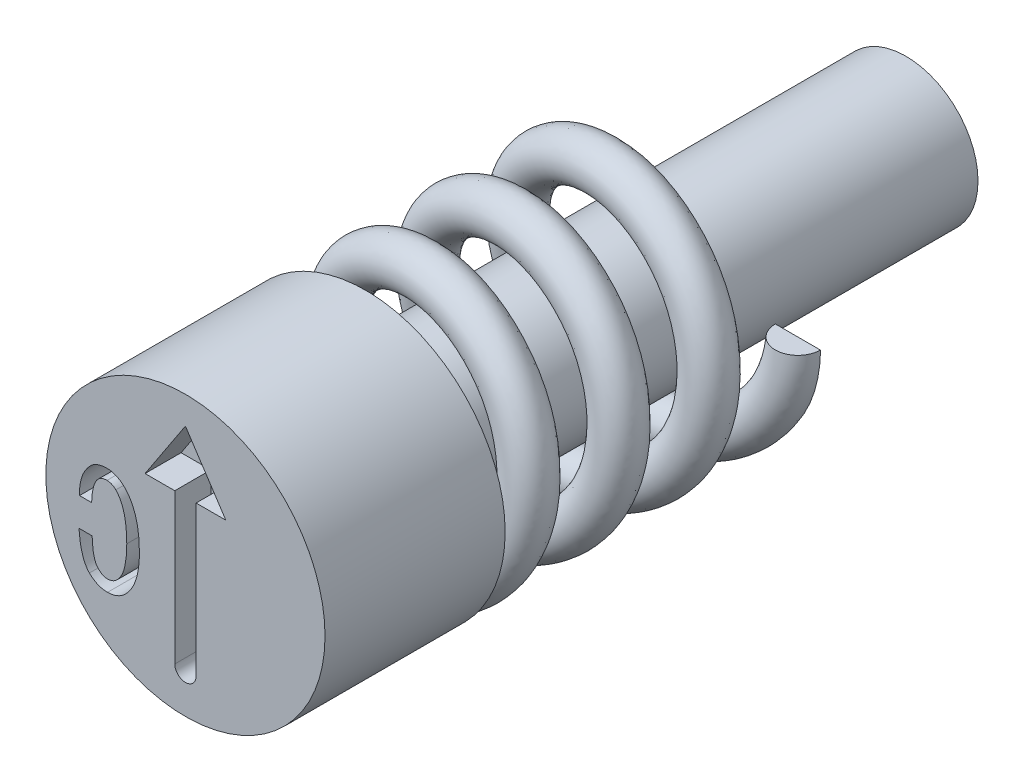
ISO-10303-21;
HEADER;
FILE_DESCRIPTION(('STEP AP214'),'2;1');
FILE_NAME('part.step','',(''),(''),'','','');
FILE_SCHEMA(('AUTOMOTIVE_DESIGN { 1 0 10303 214 1 1 1 1 }'));
ENDSEC;
DATA;
#1=APPLICATION_CONTEXT('core data for automotive mechanical design processes');
#2=APPLICATION_PROTOCOL_DEFINITION('international standard','automotive_design',2000,#1);
#3=PRODUCT_CONTEXT('',#1,'mechanical');
#4=PRODUCT('Part','Part','',(#3));
#5=PRODUCT_RELATED_PRODUCT_CATEGORY('part','',(#4));
#6=PRODUCT_DEFINITION_FORMATION('','',#4);
#7=PRODUCT_DEFINITION_CONTEXT('part definition',#1,'design');
#8=PRODUCT_DEFINITION('design','',#6,#7);
#9=PRODUCT_DEFINITION_SHAPE('','',#8);
#10=(LENGTH_UNIT() NAMED_UNIT(*) SI_UNIT(.MILLI.,.METRE.));
#11=(NAMED_UNIT(*) PLANE_ANGLE_UNIT() SI_UNIT($,.RADIAN.));
#12=(NAMED_UNIT(*) SI_UNIT($,.STERADIAN.) SOLID_ANGLE_UNIT());
#13=UNCERTAINTY_MEASURE_WITH_UNIT(LENGTH_MEASURE(1.E-05),#10,'distance_accuracy_value','');
#14=(GEOMETRIC_REPRESENTATION_CONTEXT(3) GLOBAL_UNCERTAINTY_ASSIGNED_CONTEXT((#13)) GLOBAL_UNIT_ASSIGNED_CONTEXT((#10,
#11,#12)) REPRESENTATION_CONTEXT('',''));
#15=CARTESIAN_POINT('',(0.,0.,0.));
#16=DIRECTION('',(0.,0.,1.));
#17=DIRECTION('',(1.,0.,0.));
#18=AXIS2_PLACEMENT_3D('',#15,#16,#17);
#19=CARTESIAN_POINT('',(1.3,0.,-5.75));
#20=DIRECTION('',(0.,-1.,0.));
#21=DIRECTION('',(0.,0.,-1.));
#22=AXIS2_PLACEMENT_3D('',#19,#20,#21);
#23=PLANE('',#22);
#24=CARTESIAN_POINT('',(1.3,0.,-5.5));
#25=DIRECTION('',(0.,1.,0.));
#26=DIRECTION('',(0.,0.,1.));
#27=AXIS2_PLACEMENT_3D('',#24,#25,#26);
#28=CIRCLE('',#27,0.25);
#29=CARTESIAN_POINT('',(1.05,0.,-5.5));
#30=VERTEX_POINT('',#29);
#31=CARTESIAN_POINT('',(1.55,0.,-5.5));
#32=VERTEX_POINT('',#31);
#33=EDGE_CURVE('E88',#30,#32,#28,.T.);
#34=ORIENTED_EDGE('',*,*,#33,.T.);
#35=DIRECTION('',(-1.,0.,0.));
#36=VECTOR('',#35,1.);
#37=CARTESIAN_POINT('',(1.3,0.,-5.5));
#38=LINE('',#37,#36);
#39=EDGE_CURVE('E75',#32,#30,#38,.T.);
#40=ORIENTED_EDGE('',*,*,#39,.T.);
#41=EDGE_LOOP('',(#34,#40));
#42=FACE_BOUND('',#41,.T.);
#43=ADVANCED_FACE('F49',(#42),#23,.F.);
#44=CARTESIAN_POINT('',(-1.3,0.,-2.25));
#45=DIRECTION('',(0.,1.,0.));
#46=DIRECTION('',(-1.,0.,0.));
#47=AXIS2_PLACEMENT_3D('',#44,#45,#46);
#48=PLANE('',#47);
#49=DIRECTION('',(-1.,0.,0.));
#50=VECTOR('',#49,1.);
#51=CARTESIAN_POINT('',(-1.3,0.,-2.));
#52=LINE('',#51,#50);
#53=CARTESIAN_POINT('',(-1.05,0.,-2.));
#54=VERTEX_POINT('',#53);
#55=CARTESIAN_POINT('',(-1.55,0.,-2.));
#56=VERTEX_POINT('',#55);
#57=EDGE_CURVE('E69',#54,#56,#52,.T.);
#58=ORIENTED_EDGE('',*,*,#57,.F.);
#59=CARTESIAN_POINT('',(-1.3,0.,-2.));
#60=DIRECTION('',(0.,1.,0.));
#61=DIRECTION('',(-1.,0.,0.));
#62=AXIS2_PLACEMENT_3D('',#59,#60,#61);
#63=CIRCLE('',#62,0.25);
#64=EDGE_CURVE('E85',#54,#56,#63,.T.);
#65=ORIENTED_EDGE('',*,*,#64,.T.);
#66=EDGE_LOOP('',(#58,#65));
#67=FACE_BOUND('',#66,.T.);
#68=ADVANCED_FACE('F51',(#67),#48,.T.);
#69=CARTESIAN_POINT('',(1.3,0.,-5.25));
#70=CARTESIAN_POINT('',(1.3,-0.538477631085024,-5.1875));
#71=CARTESIAN_POINT('',(0.919238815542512,-0.919238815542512,-5.125));
#72=CARTESIAN_POINT('',(0.538477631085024,-1.3,-5.0625));
#73=CARTESIAN_POINT('',(0.,-1.3,-5.));
#74=CARTESIAN_POINT('',(-0.538477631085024,-1.3,-4.9375));
#75=CARTESIAN_POINT('',(-0.919238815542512,-0.919238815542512,-4.875));
#76=CARTESIAN_POINT('',(-1.3,-0.538477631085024,-4.8125));
#77=CARTESIAN_POINT('',(-1.3,0.,-4.75));
#78=CARTESIAN_POINT('',(-1.3,0.538477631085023,-4.6875));
#79=CARTESIAN_POINT('',(-0.919238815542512,0.919238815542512,-4.625));
#80=CARTESIAN_POINT('',(-0.538477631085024,1.3,-4.5625));
#81=CARTESIAN_POINT('',(0.,1.3,-4.5));
#82=CARTESIAN_POINT('',(0.538477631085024,1.3,-4.4375));
#83=CARTESIAN_POINT('',(0.919238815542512,0.919238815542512,-4.375));
#84=CARTESIAN_POINT('',(1.3,0.538477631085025,-4.3125));
#85=CARTESIAN_POINT('',(1.3,0.,-4.25));
#86=CARTESIAN_POINT('',(1.3,-0.538477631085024,-4.1875));
#87=CARTESIAN_POINT('',(0.919238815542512,-0.919238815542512,-4.125));
#88=CARTESIAN_POINT('',(0.538477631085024,-1.3,-4.0625));
#89=CARTESIAN_POINT('',(0.,-1.3,-4.));
#90=CARTESIAN_POINT('',(-0.538477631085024,-1.3,-3.9375));
#91=CARTESIAN_POINT('',(-0.919238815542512,-0.919238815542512,-3.875));
#92=CARTESIAN_POINT('',(-1.3,-0.538477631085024,-3.8125));
#93=CARTESIAN_POINT('',(-1.3,0.,-3.75));
#94=CARTESIAN_POINT('',(-1.3,0.538477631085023,-3.6875));
#95=CARTESIAN_POINT('',(-0.919238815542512,0.919238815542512,-3.625));
#96=CARTESIAN_POINT('',(-0.538477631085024,1.3,-3.5625));
#97=CARTESIAN_POINT('',(0.,1.3,-3.5));
#98=CARTESIAN_POINT('',(0.538477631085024,1.3,-3.4375));
#99=CARTESIAN_POINT('',(0.919238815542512,0.919238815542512,-3.375));
#100=CARTESIAN_POINT('',(1.3,0.538477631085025,-3.3125));
#101=CARTESIAN_POINT('',(1.3,0.,-3.25));
#102=CARTESIAN_POINT('',(1.3,-0.538477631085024,-3.1875));
#103=CARTESIAN_POINT('',(0.919238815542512,-0.919238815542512,-3.125));
#104=CARTESIAN_POINT('',(0.538477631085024,-1.3,-3.0625));
#105=CARTESIAN_POINT('',(0.,-1.3,-3.));
#106=CARTESIAN_POINT('',(-0.538477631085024,-1.3,-2.9375));
#107=CARTESIAN_POINT('',(-0.919238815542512,-0.919238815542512,-2.875));
#108=CARTESIAN_POINT('',(-1.3,-0.538477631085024,-2.8125));
#109=CARTESIAN_POINT('',(-1.3,0.,-2.75));
#110=CARTESIAN_POINT('',(-1.3,0.538477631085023,-2.6875));
#111=CARTESIAN_POINT('',(-0.919238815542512,0.919238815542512,-2.625));
#112=CARTESIAN_POINT('',(-0.538477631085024,1.3,-2.5625));
#113=CARTESIAN_POINT('',(0.,1.3,-2.5));
#114=CARTESIAN_POINT('',(0.538477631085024,1.3,-2.4375));
#115=CARTESIAN_POINT('',(0.919238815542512,0.919238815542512,-2.375));
#116=CARTESIAN_POINT('',(1.3,0.538477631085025,-2.3125));
#117=CARTESIAN_POINT('',(1.3,0.,-2.25));
#118=CARTESIAN_POINT('',(1.3,-0.538477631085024,-2.1875));
#119=CARTESIAN_POINT('',(0.919238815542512,-0.919238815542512,-2.125));
#120=CARTESIAN_POINT('',(0.538477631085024,-1.3,-2.0625));
#121=CARTESIAN_POINT('',(0.,-1.3,-2.));
#122=CARTESIAN_POINT('',(-0.538477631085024,-1.3,-1.9375));
#123=CARTESIAN_POINT('',(-0.919238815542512,-0.919238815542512,-1.875));
#124=CARTESIAN_POINT('',(-1.3,-0.538477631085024,-1.8125));
#125=CARTESIAN_POINT('',(-1.3,0.,-1.75));
#126=CARTESIAN_POINT('',(1.8,0.,-5.25));
#127=CARTESIAN_POINT('',(1.8,-0.745584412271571,-5.1875));
#128=CARTESIAN_POINT('',(1.27279220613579,-1.27279220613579,-5.125));
#129=CARTESIAN_POINT('',(0.745584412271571,-1.8,-5.0625));
#130=CARTESIAN_POINT('',(0.,-1.8,-5.));
#131=CARTESIAN_POINT('',(-0.745584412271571,-1.8,-4.9375));
#132=CARTESIAN_POINT('',(-1.27279220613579,-1.27279220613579,-4.875));
#133=CARTESIAN_POINT('',(-1.8,-0.745584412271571,-4.8125));
#134=CARTESIAN_POINT('',(-1.8,0.,-4.75));
#135=CARTESIAN_POINT('',(-1.8,0.745584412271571,-4.6875));
#136=CARTESIAN_POINT('',(-1.27279220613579,1.27279220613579,-4.625));
#137=CARTESIAN_POINT('',(-0.745584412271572,1.8,-4.5625));
#138=CARTESIAN_POINT('',(0.,1.8,-4.5));
#139=CARTESIAN_POINT('',(0.745584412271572,1.8,-4.4375));
#140=CARTESIAN_POINT('',(1.27279220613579,1.27279220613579,-4.375));
#141=CARTESIAN_POINT('',(1.8,0.745584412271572,-4.3125));
#142=CARTESIAN_POINT('',(1.8,0.,-4.25));
#143=CARTESIAN_POINT('',(1.8,-0.745584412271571,-4.1875));
#144=CARTESIAN_POINT('',(1.27279220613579,-1.27279220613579,-4.125));
#145=CARTESIAN_POINT('',(0.745584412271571,-1.8,-4.0625));
#146=CARTESIAN_POINT('',(0.,-1.8,-4.));
#147=CARTESIAN_POINT('',(-0.745584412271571,-1.8,-3.9375));
#148=CARTESIAN_POINT('',(-1.27279220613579,-1.27279220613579,-3.875));
#149=CARTESIAN_POINT('',(-1.8,-0.745584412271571,-3.8125));
#150=CARTESIAN_POINT('',(-1.8,0.,-3.75));
#151=CARTESIAN_POINT('',(-1.8,0.745584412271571,-3.6875));
#152=CARTESIAN_POINT('',(-1.27279220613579,1.27279220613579,-3.625));
#153=CARTESIAN_POINT('',(-0.745584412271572,1.8,-3.5625));
#154=CARTESIAN_POINT('',(0.,1.8,-3.5));
#155=CARTESIAN_POINT('',(0.745584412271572,1.8,-3.4375));
#156=CARTESIAN_POINT('',(1.27279220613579,1.27279220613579,-3.375));
#157=CARTESIAN_POINT('',(1.8,0.745584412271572,-3.3125));
#158=CARTESIAN_POINT('',(1.8,0.,-3.25));
#159=CARTESIAN_POINT('',(1.8,-0.745584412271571,-3.1875));
#160=CARTESIAN_POINT('',(1.27279220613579,-1.27279220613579,-3.125));
#161=CARTESIAN_POINT('',(0.745584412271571,-1.8,-3.0625));
#162=CARTESIAN_POINT('',(0.,-1.8,-3.));
#163=CARTESIAN_POINT('',(-0.745584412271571,-1.8,-2.9375));
#164=CARTESIAN_POINT('',(-1.27279220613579,-1.27279220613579,-2.875));
#165=CARTESIAN_POINT('',(-1.8,-0.745584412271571,-2.8125));
#166=CARTESIAN_POINT('',(-1.8,0.,-2.75));
#167=CARTESIAN_POINT('',(-1.8,0.745584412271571,-2.6875));
#168=CARTESIAN_POINT('',(-1.27279220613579,1.27279220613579,-2.625));
#169=CARTESIAN_POINT('',(-0.745584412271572,1.8,-2.5625));
#170=CARTESIAN_POINT('',(0.,1.8,-2.5));
#171=CARTESIAN_POINT('',(0.745584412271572,1.8,-2.4375));
#172=CARTESIAN_POINT('',(1.27279220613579,1.27279220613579,-2.375));
#173=CARTESIAN_POINT('',(1.8,0.745584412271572,-2.3125));
#174=CARTESIAN_POINT('',(1.8,0.,-2.25));
#175=CARTESIAN_POINT('',(1.8,-0.745584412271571,-2.1875));
#176=CARTESIAN_POINT('',(1.27279220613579,-1.27279220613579,-2.125));
#177=CARTESIAN_POINT('',(0.745584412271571,-1.8,-2.0625));
#178=CARTESIAN_POINT('',(0.,-1.8,-2.));
#179=CARTESIAN_POINT('',(-0.745584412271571,-1.8,-1.9375));
#180=CARTESIAN_POINT('',(-1.27279220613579,-1.27279220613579,-1.875));
#181=CARTESIAN_POINT('',(-1.8,-0.745584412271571,-1.8125));
#182=CARTESIAN_POINT('',(-1.8,0.,-1.75));
#183=CARTESIAN_POINT('',(1.8,0.,-5.75));
#184=CARTESIAN_POINT('',(1.8,-0.745584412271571,-5.6875));
#185=CARTESIAN_POINT('',(1.27279220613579,-1.27279220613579,-5.625));
#186=CARTESIAN_POINT('',(0.745584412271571,-1.8,-5.5625));
#187=CARTESIAN_POINT('',(0.,-1.8,-5.5));
#188=CARTESIAN_POINT('',(-0.745584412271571,-1.8,-5.4375));
#189=CARTESIAN_POINT('',(-1.27279220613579,-1.27279220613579,-5.375));
#190=CARTESIAN_POINT('',(-1.8,-0.745584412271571,-5.3125));
#191=CARTESIAN_POINT('',(-1.8,0.,-5.25));
#192=CARTESIAN_POINT('',(-1.8,0.745584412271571,-5.1875));
#193=CARTESIAN_POINT('',(-1.27279220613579,1.27279220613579,-5.125));
#194=CARTESIAN_POINT('',(-0.745584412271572,1.8,-5.0625));
#195=CARTESIAN_POINT('',(0.,1.8,-5.));
#196=CARTESIAN_POINT('',(0.745584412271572,1.8,-4.9375));
#197=CARTESIAN_POINT('',(1.27279220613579,1.27279220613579,-4.875));
#198=CARTESIAN_POINT('',(1.8,0.745584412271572,-4.8125));
#199=CARTESIAN_POINT('',(1.8,0.,-4.75));
#200=CARTESIAN_POINT('',(1.8,-0.745584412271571,-4.6875));
#201=CARTESIAN_POINT('',(1.27279220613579,-1.27279220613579,-4.625));
#202=CARTESIAN_POINT('',(0.745584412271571,-1.8,-4.5625));
#203=CARTESIAN_POINT('',(0.,-1.8,-4.5));
#204=CARTESIAN_POINT('',(-0.745584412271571,-1.8,-4.4375));
#205=CARTESIAN_POINT('',(-1.27279220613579,-1.27279220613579,-4.375));
#206=CARTESIAN_POINT('',(-1.8,-0.745584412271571,-4.3125));
#207=CARTESIAN_POINT('',(-1.8,0.,-4.25));
#208=CARTESIAN_POINT('',(-1.8,0.745584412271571,-4.1875));
#209=CARTESIAN_POINT('',(-1.27279220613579,1.27279220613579,-4.125));
#210=CARTESIAN_POINT('',(-0.745584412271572,1.8,-4.0625));
#211=CARTESIAN_POINT('',(0.,1.8,-4.));
#212=CARTESIAN_POINT('',(0.745584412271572,1.8,-3.9375));
#213=CARTESIAN_POINT('',(1.27279220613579,1.27279220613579,-3.875));
#214=CARTESIAN_POINT('',(1.8,0.745584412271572,-3.8125));
#215=CARTESIAN_POINT('',(1.8,0.,-3.75));
#216=CARTESIAN_POINT('',(1.8,-0.745584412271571,-3.6875));
#217=CARTESIAN_POINT('',(1.27279220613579,-1.27279220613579,-3.625));
#218=CARTESIAN_POINT('',(0.745584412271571,-1.8,-3.5625));
#219=CARTESIAN_POINT('',(0.,-1.8,-3.5));
#220=CARTESIAN_POINT('',(-0.745584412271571,-1.8,-3.4375));
#221=CARTESIAN_POINT('',(-1.27279220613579,-1.27279220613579,-3.375));
#222=CARTESIAN_POINT('',(-1.8,-0.745584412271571,-3.3125));
#223=CARTESIAN_POINT('',(-1.8,0.,-3.25));
#224=CARTESIAN_POINT('',(-1.8,0.745584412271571,-3.1875));
#225=CARTESIAN_POINT('',(-1.27279220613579,1.27279220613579,-3.125));
#226=CARTESIAN_POINT('',(-0.745584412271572,1.8,-3.0625));
#227=CARTESIAN_POINT('',(0.,1.8,-3.));
#228=CARTESIAN_POINT('',(0.745584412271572,1.8,-2.9375));
#229=CARTESIAN_POINT('',(1.27279220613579,1.27279220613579,-2.875));
#230=CARTESIAN_POINT('',(1.8,0.745584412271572,-2.8125));
#231=CARTESIAN_POINT('',(1.8,0.,-2.75));
#232=CARTESIAN_POINT('',(1.8,-0.745584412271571,-2.6875));
#233=CARTESIAN_POINT('',(1.27279220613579,-1.27279220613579,-2.625));
#234=CARTESIAN_POINT('',(0.745584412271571,-1.8,-2.5625));
#235=CARTESIAN_POINT('',(0.,-1.8,-2.5));
#236=CARTESIAN_POINT('',(-0.745584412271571,-1.8,-2.4375));
#237=CARTESIAN_POINT('',(-1.27279220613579,-1.27279220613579,-2.375));
#238=CARTESIAN_POINT('',(-1.8,-0.745584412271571,-2.3125));
#239=CARTESIAN_POINT('',(-1.8,0.,-2.25));
#240=CARTESIAN_POINT('',(1.3,0.,-5.75));
#241=CARTESIAN_POINT('',(1.3,-0.538477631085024,-5.6875));
#242=CARTESIAN_POINT('',(0.919238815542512,-0.919238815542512,-5.625));
#243=CARTESIAN_POINT('',(0.538477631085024,-1.3,-5.5625));
#244=CARTESIAN_POINT('',(0.,-1.3,-5.5));
#245=CARTESIAN_POINT('',(-0.538477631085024,-1.3,-5.4375));
#246=CARTESIAN_POINT('',(-0.919238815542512,-0.919238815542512,-5.375));
#247=CARTESIAN_POINT('',(-1.3,-0.538477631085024,-5.3125));
#248=CARTESIAN_POINT('',(-1.3,0.,-5.25));
#249=CARTESIAN_POINT('',(-1.3,0.538477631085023,-5.1875));
#250=CARTESIAN_POINT('',(-0.919238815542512,0.919238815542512,-5.125));
#251=CARTESIAN_POINT('',(-0.538477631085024,1.3,-5.0625));
#252=CARTESIAN_POINT('',(0.,1.3,-5.));
#253=CARTESIAN_POINT('',(0.538477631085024,1.3,-4.9375));
#254=CARTESIAN_POINT('',(0.919238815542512,0.919238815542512,-4.875));
#255=CARTESIAN_POINT('',(1.3,0.538477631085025,-4.8125));
#256=CARTESIAN_POINT('',(1.3,0.,-4.75));
#257=CARTESIAN_POINT('',(1.3,-0.538477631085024,-4.6875));
#258=CARTESIAN_POINT('',(0.919238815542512,-0.919238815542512,-4.625));
#259=CARTESIAN_POINT('',(0.538477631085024,-1.3,-4.5625));
#260=CARTESIAN_POINT('',(0.,-1.3,-4.5));
#261=CARTESIAN_POINT('',(-0.538477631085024,-1.3,-4.4375));
#262=CARTESIAN_POINT('',(-0.919238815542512,-0.919238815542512,-4.375));
#263=CARTESIAN_POINT('',(-1.3,-0.538477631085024,-4.3125));
#264=CARTESIAN_POINT('',(-1.3,0.,-4.25));
#265=CARTESIAN_POINT('',(-1.3,0.538477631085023,-4.1875));
#266=CARTESIAN_POINT('',(-0.919238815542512,0.919238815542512,-4.125));
#267=CARTESIAN_POINT('',(-0.538477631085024,1.3,-4.0625));
#268=CARTESIAN_POINT('',(0.,1.3,-4.));
#269=CARTESIAN_POINT('',(0.538477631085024,1.3,-3.9375));
#270=CARTESIAN_POINT('',(0.919238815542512,0.919238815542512,-3.875));
#271=CARTESIAN_POINT('',(1.3,0.538477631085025,-3.8125));
#272=CARTESIAN_POINT('',(1.3,0.,-3.75));
#273=CARTESIAN_POINT('',(1.3,-0.538477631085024,-3.6875));
#274=CARTESIAN_POINT('',(0.919238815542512,-0.919238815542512,-3.625));
#275=CARTESIAN_POINT('',(0.538477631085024,-1.3,-3.5625));
#276=CARTESIAN_POINT('',(0.,-1.3,-3.5));
#277=CARTESIAN_POINT('',(-0.538477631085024,-1.3,-3.4375));
#278=CARTESIAN_POINT('',(-0.919238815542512,-0.919238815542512,-3.375));
#279=CARTESIAN_POINT('',(-1.3,-0.538477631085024,-3.3125));
#280=CARTESIAN_POINT('',(-1.3,0.,-3.25));
#281=CARTESIAN_POINT('',(-1.3,0.538477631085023,-3.1875));
#282=CARTESIAN_POINT('',(-0.919238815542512,0.919238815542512,-3.125));
#283=CARTESIAN_POINT('',(-0.538477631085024,1.3,-3.0625));
#284=CARTESIAN_POINT('',(0.,1.3,-3.));
#285=CARTESIAN_POINT('',(0.538477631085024,1.3,-2.9375));
#286=CARTESIAN_POINT('',(0.919238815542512,0.919238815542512,-2.875));
#287=CARTESIAN_POINT('',(1.3,0.538477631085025,-2.8125));
#288=CARTESIAN_POINT('',(1.3,0.,-2.75));
#289=CARTESIAN_POINT('',(1.3,-0.538477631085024,-2.6875));
#290=CARTESIAN_POINT('',(0.919238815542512,-0.919238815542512,-2.625));
#291=CARTESIAN_POINT('',(0.538477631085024,-1.3,-2.5625));
#292=CARTESIAN_POINT('',(0.,-1.3,-2.5));
#293=CARTESIAN_POINT('',(-0.538477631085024,-1.3,-2.4375));
#294=CARTESIAN_POINT('',(-0.919238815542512,-0.919238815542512,-2.375));
#295=CARTESIAN_POINT('',(-1.3,-0.538477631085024,-2.3125));
#296=CARTESIAN_POINT('',(-1.3,0.,-2.25));
#297=CARTESIAN_POINT('',(0.8,0.,-5.75));
#298=CARTESIAN_POINT('',(0.8,-0.331370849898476,-5.6875));
#299=CARTESIAN_POINT('',(0.565685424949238,-0.565685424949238,-5.625));
#300=CARTESIAN_POINT('',(0.331370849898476,-0.8,-5.5625));
#301=CARTESIAN_POINT('',(0.,-0.8,-5.5));
#302=CARTESIAN_POINT('',(-0.331370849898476,-0.8,-5.4375));
#303=CARTESIAN_POINT('',(-0.565685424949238,-0.565685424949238,-5.375));
#304=CARTESIAN_POINT('',(-0.8,-0.331370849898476,-5.3125));
#305=CARTESIAN_POINT('',(-0.8,0.,-5.25));
#306=CARTESIAN_POINT('',(-0.8,0.331370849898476,-5.1875));
#307=CARTESIAN_POINT('',(-0.565685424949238,0.565685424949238,-5.125));
#308=CARTESIAN_POINT('',(-0.331370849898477,0.8,-5.0625));
#309=CARTESIAN_POINT('',(0.,0.8,-5.));
#310=CARTESIAN_POINT('',(0.331370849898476,0.8,-4.9375));
#311=CARTESIAN_POINT('',(0.565685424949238,0.565685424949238,-4.875));
#312=CARTESIAN_POINT('',(0.8,0.331370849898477,-4.8125));
#313=CARTESIAN_POINT('',(0.8,0.,-4.75));
#314=CARTESIAN_POINT('',(0.8,-0.331370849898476,-4.6875));
#315=CARTESIAN_POINT('',(0.565685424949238,-0.565685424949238,-4.625));
#316=CARTESIAN_POINT('',(0.331370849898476,-0.8,-4.5625));
#317=CARTESIAN_POINT('',(0.,-0.8,-4.5));
#318=CARTESIAN_POINT('',(-0.331370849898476,-0.8,-4.4375));
#319=CARTESIAN_POINT('',(-0.565685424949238,-0.565685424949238,-4.375));
#320=CARTESIAN_POINT('',(-0.8,-0.331370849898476,-4.3125));
#321=CARTESIAN_POINT('',(-0.8,0.,-4.25));
#322=CARTESIAN_POINT('',(-0.8,0.331370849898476,-4.1875));
#323=CARTESIAN_POINT('',(-0.565685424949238,0.565685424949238,-4.125));
#324=CARTESIAN_POINT('',(-0.331370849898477,0.8,-4.0625));
#325=CARTESIAN_POINT('',(0.,0.8,-4.));
#326=CARTESIAN_POINT('',(0.331370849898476,0.8,-3.9375));
#327=CARTESIAN_POINT('',(0.565685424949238,0.565685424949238,-3.875));
#328=CARTESIAN_POINT('',(0.8,0.331370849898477,-3.8125));
#329=CARTESIAN_POINT('',(0.8,0.,-3.75));
#330=CARTESIAN_POINT('',(0.8,-0.331370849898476,-3.6875));
#331=CARTESIAN_POINT('',(0.565685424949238,-0.565685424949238,-3.625));
#332=CARTESIAN_POINT('',(0.331370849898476,-0.8,-3.5625));
#333=CARTESIAN_POINT('',(0.,-0.8,-3.5));
#334=CARTESIAN_POINT('',(-0.331370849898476,-0.8,-3.4375));
#335=CARTESIAN_POINT('',(-0.565685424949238,-0.565685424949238,-3.375));
#336=CARTESIAN_POINT('',(-0.8,-0.331370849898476,-3.3125));
#337=CARTESIAN_POINT('',(-0.8,0.,-3.25));
#338=CARTESIAN_POINT('',(-0.8,0.331370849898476,-3.1875));
#339=CARTESIAN_POINT('',(-0.565685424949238,0.565685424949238,-3.125));
#340=CARTESIAN_POINT('',(-0.331370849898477,0.8,-3.0625));
#341=CARTESIAN_POINT('',(0.,0.8,-3.));
#342=CARTESIAN_POINT('',(0.331370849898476,0.8,-2.9375));
#343=CARTESIAN_POINT('',(0.565685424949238,0.565685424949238,-2.875));
#344=CARTESIAN_POINT('',(0.8,0.331370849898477,-2.8125));
#345=CARTESIAN_POINT('',(0.8,0.,-2.75));
#346=CARTESIAN_POINT('',(0.8,-0.331370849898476,-2.6875));
#347=CARTESIAN_POINT('',(0.565685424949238,-0.565685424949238,-2.625));
#348=CARTESIAN_POINT('',(0.331370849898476,-0.8,-2.5625));
#349=CARTESIAN_POINT('',(0.,-0.8,-2.5));
#350=CARTESIAN_POINT('',(-0.331370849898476,-0.8,-2.4375));
#351=CARTESIAN_POINT('',(-0.565685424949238,-0.565685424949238,-2.375));
#352=CARTESIAN_POINT('',(-0.8,-0.331370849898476,-2.3125));
#353=CARTESIAN_POINT('',(-0.8,0.,-2.25));
#354=CARTESIAN_POINT('',(0.8,0.,-5.25));
#355=CARTESIAN_POINT('',(0.8,-0.331370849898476,-5.1875));
#356=CARTESIAN_POINT('',(0.565685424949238,-0.565685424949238,-5.125));
#357=CARTESIAN_POINT('',(0.331370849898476,-0.8,-5.0625));
#358=CARTESIAN_POINT('',(0.,-0.8,-5.));
#359=CARTESIAN_POINT('',(-0.331370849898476,-0.8,-4.9375));
#360=CARTESIAN_POINT('',(-0.565685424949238,-0.565685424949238,-4.875));
#361=CARTESIAN_POINT('',(-0.8,-0.331370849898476,-4.8125));
#362=CARTESIAN_POINT('',(-0.8,0.,-4.75));
#363=CARTESIAN_POINT('',(-0.8,0.331370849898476,-4.6875));
#364=CARTESIAN_POINT('',(-0.565685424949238,0.565685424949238,-4.625));
#365=CARTESIAN_POINT('',(-0.331370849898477,0.8,-4.5625));
#366=CARTESIAN_POINT('',(0.,0.8,-4.5));
#367=CARTESIAN_POINT('',(0.331370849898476,0.8,-4.4375));
#368=CARTESIAN_POINT('',(0.565685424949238,0.565685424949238,-4.375));
#369=CARTESIAN_POINT('',(0.8,0.331370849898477,-4.3125));
#370=CARTESIAN_POINT('',(0.8,0.,-4.25));
#371=CARTESIAN_POINT('',(0.8,-0.331370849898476,-4.1875));
#372=CARTESIAN_POINT('',(0.565685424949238,-0.565685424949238,-4.125));
#373=CARTESIAN_POINT('',(0.331370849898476,-0.8,-4.0625));
#374=CARTESIAN_POINT('',(0.,-0.8,-4.));
#375=CARTESIAN_POINT('',(-0.331370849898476,-0.8,-3.9375));
#376=CARTESIAN_POINT('',(-0.565685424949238,-0.565685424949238,-3.875));
#377=CARTESIAN_POINT('',(-0.8,-0.331370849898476,-3.8125));
#378=CARTESIAN_POINT('',(-0.8,0.,-3.75));
#379=CARTESIAN_POINT('',(-0.8,0.331370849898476,-3.6875));
#380=CARTESIAN_POINT('',(-0.565685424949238,0.565685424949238,-3.625));
#381=CARTESIAN_POINT('',(-0.331370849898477,0.8,-3.5625));
#382=CARTESIAN_POINT('',(0.,0.8,-3.5));
#383=CARTESIAN_POINT('',(0.331370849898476,0.8,-3.4375));
#384=CARTESIAN_POINT('',(0.565685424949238,0.565685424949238,-3.375));
#385=CARTESIAN_POINT('',(0.8,0.331370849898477,-3.3125));
#386=CARTESIAN_POINT('',(0.8,0.,-3.25));
#387=CARTESIAN_POINT('',(0.8,-0.331370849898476,-3.1875));
#388=CARTESIAN_POINT('',(0.565685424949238,-0.565685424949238,-3.125));
#389=CARTESIAN_POINT('',(0.331370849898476,-0.8,-3.0625));
#390=CARTESIAN_POINT('',(0.,-0.8,-3.));
#391=CARTESIAN_POINT('',(-0.331370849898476,-0.8,-2.9375));
#392=CARTESIAN_POINT('',(-0.565685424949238,-0.565685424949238,-2.875));
#393=CARTESIAN_POINT('',(-0.8,-0.331370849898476,-2.8125));
#394=CARTESIAN_POINT('',(-0.8,0.,-2.75));
#395=CARTESIAN_POINT('',(-0.8,0.331370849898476,-2.6875));
#396=CARTESIAN_POINT('',(-0.565685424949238,0.565685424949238,-2.625));
#397=CARTESIAN_POINT('',(-0.331370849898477,0.8,-2.5625));
#398=CARTESIAN_POINT('',(0.,0.8,-2.5));
#399=CARTESIAN_POINT('',(0.331370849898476,0.8,-2.4375));
#400=CARTESIAN_POINT('',(0.565685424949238,0.565685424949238,-2.375));
#401=CARTESIAN_POINT('',(0.8,0.331370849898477,-2.3125));
#402=CARTESIAN_POINT('',(0.8,0.,-2.25));
#403=CARTESIAN_POINT('',(0.8,-0.331370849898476,-2.1875));
#404=CARTESIAN_POINT('',(0.565685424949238,-0.565685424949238,-2.125));
#405=CARTESIAN_POINT('',(0.331370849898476,-0.8,-2.0625));
#406=CARTESIAN_POINT('',(0.,-0.8,-2.));
#407=CARTESIAN_POINT('',(-0.331370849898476,-0.8,-1.9375));
#408=CARTESIAN_POINT('',(-0.565685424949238,-0.565685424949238,-1.875));
#409=CARTESIAN_POINT('',(-0.8,-0.331370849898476,-1.8125));
#410=CARTESIAN_POINT('',(-0.8,0.,-1.75));
#411=CARTESIAN_POINT('',(1.3,0.,-5.25));
#412=CARTESIAN_POINT('',(1.3,-0.538477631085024,-5.1875));
#413=CARTESIAN_POINT('',(0.919238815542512,-0.919238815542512,-5.125));
#414=CARTESIAN_POINT('',(0.538477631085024,-1.3,-5.0625));
#415=CARTESIAN_POINT('',(0.,-1.3,-5.));
#416=CARTESIAN_POINT('',(-0.538477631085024,-1.3,-4.9375));
#417=CARTESIAN_POINT('',(-0.919238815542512,-0.919238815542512,-4.875));
#418=CARTESIAN_POINT('',(-1.3,-0.538477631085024,-4.8125));
#419=CARTESIAN_POINT('',(-1.3,0.,-4.75));
#420=CARTESIAN_POINT('',(-1.3,0.538477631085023,-4.6875));
#421=CARTESIAN_POINT('',(-0.919238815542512,0.919238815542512,-4.625));
#422=CARTESIAN_POINT('',(-0.538477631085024,1.3,-4.5625));
#423=CARTESIAN_POINT('',(0.,1.3,-4.5));
#424=CARTESIAN_POINT('',(0.538477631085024,1.3,-4.4375));
#425=CARTESIAN_POINT('',(0.919238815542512,0.919238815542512,-4.375));
#426=CARTESIAN_POINT('',(1.3,0.538477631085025,-4.3125));
#427=CARTESIAN_POINT('',(1.3,0.,-4.25));
#428=CARTESIAN_POINT('',(1.3,-0.538477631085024,-4.1875));
#429=CARTESIAN_POINT('',(0.919238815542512,-0.919238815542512,-4.125));
#430=CARTESIAN_POINT('',(0.538477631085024,-1.3,-4.0625));
#431=CARTESIAN_POINT('',(0.,-1.3,-4.));
#432=CARTESIAN_POINT('',(-0.538477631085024,-1.3,-3.9375));
#433=CARTESIAN_POINT('',(-0.919238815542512,-0.919238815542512,-3.875));
#434=CARTESIAN_POINT('',(-1.3,-0.538477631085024,-3.8125));
#435=CARTESIAN_POINT('',(-1.3,0.,-3.75));
#436=CARTESIAN_POINT('',(-1.3,0.538477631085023,-3.6875));
#437=CARTESIAN_POINT('',(-0.919238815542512,0.919238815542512,-3.625));
#438=CARTESIAN_POINT('',(-0.538477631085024,1.3,-3.5625));
#439=CARTESIAN_POINT('',(0.,1.3,-3.5));
#440=CARTESIAN_POINT('',(0.538477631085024,1.3,-3.4375));
#441=CARTESIAN_POINT('',(0.919238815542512,0.919238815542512,-3.375));
#442=CARTESIAN_POINT('',(1.3,0.538477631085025,-3.3125));
#443=CARTESIAN_POINT('',(1.3,0.,-3.25));
#444=CARTESIAN_POINT('',(1.3,-0.538477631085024,-3.1875));
#445=CARTESIAN_POINT('',(0.919238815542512,-0.919238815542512,-3.125));
#446=CARTESIAN_POINT('',(0.538477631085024,-1.3,-3.0625));
#447=CARTESIAN_POINT('',(0.,-1.3,-3.));
#448=CARTESIAN_POINT('',(-0.538477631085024,-1.3,-2.9375));
#449=CARTESIAN_POINT('',(-0.919238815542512,-0.919238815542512,-2.875));
#450=CARTESIAN_POINT('',(-1.3,-0.538477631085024,-2.8125));
#451=CARTESIAN_POINT('',(-1.3,0.,-2.75));
#452=CARTESIAN_POINT('',(-1.3,0.538477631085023,-2.6875));
#453=CARTESIAN_POINT('',(-0.919238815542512,0.919238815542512,-2.625));
#454=CARTESIAN_POINT('',(-0.538477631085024,1.3,-2.5625));
#455=CARTESIAN_POINT('',(0.,1.3,-2.5));
#456=CARTESIAN_POINT('',(0.538477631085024,1.3,-2.4375));
#457=CARTESIAN_POINT('',(0.919238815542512,0.919238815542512,-2.375));
#458=CARTESIAN_POINT('',(1.3,0.538477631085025,-2.3125));
#459=CARTESIAN_POINT('',(1.3,0.,-2.25));
#460=CARTESIAN_POINT('',(1.3,-0.538477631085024,-2.1875));
#461=CARTESIAN_POINT('',(0.919238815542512,-0.919238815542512,-2.125));
#462=CARTESIAN_POINT('',(0.538477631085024,-1.3,-2.0625));
#463=CARTESIAN_POINT('',(0.,-1.3,-2.));
#464=CARTESIAN_POINT('',(-0.538477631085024,-1.3,-1.9375));
#465=CARTESIAN_POINT('',(-0.919238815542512,-0.919238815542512,-1.875));
#466=CARTESIAN_POINT('',(-1.3,-0.538477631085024,-1.8125));
#467=CARTESIAN_POINT('',(-1.3,0.,-1.75));
#468=(BOUNDED_SURFACE() B_SPLINE_SURFACE(3,2,((#69,#70,#71,#72,#73,#74,#75,#76,#77,#78,#79,#80,
#81,#82,#83,#84,#85,#86,#87,#88,#89,#90,#91,#92,#93,#94,#95,#96,#97,#98,#99,#100,#101,#102,#103,
#104,#105,#106,#107,#108,#109,#110,#111,#112,#113,#114,#115,#116,#117,#118,#119,#120,#121,#122,
#123,#124,#125),(#126,#127,#128,#129,#130,#131,#132,#133,#134,#135,#136,#137,#138,#139,#140,
#141,#142,#143,#144,#145,#146,#147,#148,#149,#150,#151,#152,#153,#154,#155,#156,#157,#158,#159,
#160,#161,#162,#163,#164,#165,#166,#167,#168,#169,#170,#171,#172,#173,#174,#175,#176,#177,#178,
#179,#180,#181,#182),(#183,#184,#185,#186,#187,#188,#189,#190,#191,#192,#193,#194,#195,#196,
#197,#198,#199,#200,#201,#202,#203,#204,#205,#206,#207,#208,#209,#210,#211,#212,#213,#214,#215,
#216,#217,#218,#219,#220,#221,#222,#223,#224,#225,#226,#227,#228,#229,#230,#231,#232,#233,#234,
#235,#236,#237,#238,#239),(#240,#241,#242,#243,#244,#245,#246,#247,#248,#249,#250,#251,#252,
#253,#254,#255,#256,#257,#258,#259,#260,#261,#262,#263,#264,#265,#266,#267,#268,#269,#270,#271,
#272,#273,#274,#275,#276,#277,#278,#279,#280,#281,#282,#283,#284,#285,#286,#287,#288,#289,#290,
#291,#292,#293,#294,#295,#296),(#297,#298,#299,#300,#301,#302,#303,#304,#305,#306,#307,#308,
#309,#310,#311,#312,#313,#314,#315,#316,#317,#318,#319,#320,#321,#322,#323,#324,#325,#326,#327,
#328,#329,#330,#331,#332,#333,#334,#335,#336,#337,#338,#339,#340,#341,#342,#343,#344,#345,#346,
#347,#348,#349,#350,#351,#352,#353),(#354,#355,#356,#357,#358,#359,#360,#361,#362,#363,#364,
#365,#366,#367,#368,#369,#370,#371,#372,#373,#374,#375,#376,#377,#378,#379,#380,#381,#382,#383,
#384,#385,#386,#387,#388,#389,#390,#391,#392,#393,#394,#395,#396,#397,#398,#399,#400,#401,#402,
#403,#404,#405,#406,#407,#408,#409,#410),(#411,#412,#413,#414,#415,#416,#417,#418,#419,#420,
#421,#422,#423,#424,#425,#426,#427,#428,#429,#430,#431,#432,#433,#434,#435,#436,#437,#438,#439,
#440,#441,#442,#443,#444,#445,#446,#447,#448,#449,#450,#451,#452,#453,#454,#455,#456,#457,#458,
#459,#460,#461,#462,#463,#464,#465,#466,#467)),.UNSPECIFIED.,.T.,.F.,
.F.) B_SPLINE_SURFACE_WITH_KNOTS((4,3,4),(3,2,2,2,2,2,2,2,2,2,2,2,2,2,2,2,2,2,2,2,2,2,2,2,2,2,2,
2,3),(0.,0.5,1.),(0.,0.03125,0.0625,0.09375,0.125,0.15625,0.1875,0.21875,0.25,0.28125,0.3125,
0.34375,0.375,0.40625,0.4375,0.46875,0.5,0.53125,0.5625,0.59375,0.625,0.65625,0.6875,0.71875,
0.75,0.78125,0.8125,0.84375,0.875),
.UNSPECIFIED.) GEOMETRIC_REPRESENTATION_ITEM() RATIONAL_B_SPLINE_SURFACE(((1.,0.923879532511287,
1.,0.923879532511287,1.,0.923879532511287,1.,0.923879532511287,1.,0.923879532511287,1.,
0.923879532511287,1.,0.923879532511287,1.,0.923879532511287,1.,0.923879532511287,1.,
0.923879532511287,1.,0.923879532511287,1.,0.923879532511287,1.,0.923879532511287,1.,
0.923879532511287,1.,0.923879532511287,1.,0.923879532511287,1.,0.923879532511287,1.,
0.923879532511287,1.,0.923879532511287,1.,0.923879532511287,1.,0.923879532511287,1.,
0.923879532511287,1.,0.923879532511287,1.,0.923879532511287,1.,0.923879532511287,1.,
0.923879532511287,1.,0.923879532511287,1.,0.923879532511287,1.),(0.333333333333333,
0.307959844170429,0.333333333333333,0.307959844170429,0.333333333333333,0.307959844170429,
0.333333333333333,0.307959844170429,0.333333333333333,0.307959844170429,0.333333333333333,
0.307959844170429,0.333333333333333,0.307959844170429,0.333333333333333,0.307959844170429,
0.333333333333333,0.307959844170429,0.333333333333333,0.307959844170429,0.333333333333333,
0.307959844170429,0.333333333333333,0.307959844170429,0.333333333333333,0.307959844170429,
0.333333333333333,0.307959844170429,0.333333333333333,0.307959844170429,0.333333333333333,
0.307959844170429,0.333333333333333,0.307959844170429,0.333333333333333,0.307959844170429,
0.333333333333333,0.307959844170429,0.333333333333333,0.307959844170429,0.333333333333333,
0.307959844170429,0.333333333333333,0.307959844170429,0.333333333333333,0.307959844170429,
0.333333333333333,0.307959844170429,0.333333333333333,0.307959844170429,0.333333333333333,
0.307959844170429,0.333333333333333,0.307959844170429,0.333333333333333,0.307959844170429,
0.333333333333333),(0.333333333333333,0.307959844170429,0.333333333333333,0.307959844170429,
0.333333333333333,0.307959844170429,0.333333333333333,0.307959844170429,0.333333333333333,
0.307959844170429,0.333333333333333,0.307959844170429,0.333333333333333,0.307959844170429,
0.333333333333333,0.307959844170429,0.333333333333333,0.307959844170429,0.333333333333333,
0.307959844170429,0.333333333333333,0.307959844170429,0.333333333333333,0.307959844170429,
0.333333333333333,0.307959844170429,0.333333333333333,0.307959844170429,0.333333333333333,
0.307959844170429,0.333333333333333,0.307959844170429,0.333333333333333,0.307959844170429,
0.333333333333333,0.307959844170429,0.333333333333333,0.307959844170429,0.333333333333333,
0.307959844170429,0.333333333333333,0.307959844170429,0.333333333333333,0.307959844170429,
0.333333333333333,0.307959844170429,0.333333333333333,0.307959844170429,0.333333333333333,
0.307959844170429,0.333333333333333,0.307959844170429,0.333333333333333,0.307959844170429,
0.333333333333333,0.307959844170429,0.333333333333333),(1.,0.923879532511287,1.,
0.923879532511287,1.,0.923879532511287,1.,0.923879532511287,1.,0.923879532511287,1.,
0.923879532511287,1.,0.923879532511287,1.,0.923879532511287,1.,0.923879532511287,1.,
0.923879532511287,1.,0.923879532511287,1.,0.923879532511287,1.,0.923879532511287,1.,
0.923879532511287,1.,0.923879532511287,1.,0.923879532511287,1.,0.923879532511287,1.,
0.923879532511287,1.,0.923879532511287,1.,0.923879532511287,1.,0.923879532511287,1.,
0.923879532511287,1.,0.923879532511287,1.,0.923879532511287,1.,0.923879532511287,1.,
0.923879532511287,1.,0.923879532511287,1.,0.923879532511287,1.),(0.333333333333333,
0.307959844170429,0.333333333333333,0.307959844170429,0.333333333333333,0.307959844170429,
0.333333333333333,0.307959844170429,0.333333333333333,0.307959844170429,0.333333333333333,
0.307959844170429,0.333333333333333,0.307959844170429,0.333333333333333,0.307959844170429,
0.333333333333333,0.307959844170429,0.333333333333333,0.307959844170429,0.333333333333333,
0.307959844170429,0.333333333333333,0.307959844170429,0.333333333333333,0.307959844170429,
0.333333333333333,0.307959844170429,0.333333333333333,0.307959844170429,0.333333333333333,
0.307959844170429,0.333333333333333,0.307959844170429,0.333333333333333,0.307959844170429,
0.333333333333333,0.307959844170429,0.333333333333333,0.307959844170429,0.333333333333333,
0.307959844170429,0.333333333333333,0.307959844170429,0.333333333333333,0.307959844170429,
0.333333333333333,0.307959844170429,0.333333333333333,0.307959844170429,0.333333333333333,
0.307959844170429,0.333333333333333,0.307959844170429,0.333333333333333,0.307959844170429,
0.333333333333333),(0.333333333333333,0.307959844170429,0.333333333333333,0.307959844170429,
0.333333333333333,0.307959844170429,0.333333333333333,0.307959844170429,0.333333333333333,
0.307959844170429,0.333333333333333,0.307959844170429,0.333333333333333,0.307959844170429,
0.333333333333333,0.307959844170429,0.333333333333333,0.307959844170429,0.333333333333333,
0.307959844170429,0.333333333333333,0.307959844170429,0.333333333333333,0.307959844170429,
0.333333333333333,0.307959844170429,0.333333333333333,0.307959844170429,0.333333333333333,
0.307959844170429,0.333333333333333,0.307959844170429,0.333333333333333,0.307959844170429,
0.333333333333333,0.307959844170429,0.333333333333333,0.307959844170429,0.333333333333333,
0.307959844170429,0.333333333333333,0.307959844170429,0.333333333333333,0.307959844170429,
0.333333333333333,0.307959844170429,0.333333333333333,0.307959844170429,0.333333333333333,
0.307959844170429,0.333333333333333,0.307959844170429,0.333333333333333,0.307959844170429,
0.333333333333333,0.307959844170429,0.333333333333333),(1.,0.923879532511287,1.,
0.923879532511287,1.,0.923879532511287,1.,0.923879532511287,1.,0.923879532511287,1.,
0.923879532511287,1.,0.923879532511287,1.,0.923879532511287,1.,0.923879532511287,1.,
0.923879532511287,1.,0.923879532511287,1.,0.923879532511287,1.,0.923879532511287,1.,
0.923879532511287,1.,0.923879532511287,1.,0.923879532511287,1.,0.923879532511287,1.,
0.923879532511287,1.,0.923879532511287,1.,0.923879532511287,1.,0.923879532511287,1.,
0.923879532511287,1.,0.923879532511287,1.,0.923879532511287,1.,0.923879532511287,1.,
0.923879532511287,1.,0.923879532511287,1.,0.923879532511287,1.))) REPRESENTATION_ITEM('') SURFACE());
#469=CARTESIAN_POINT('',(1.05,0.,-5.5));
#470=CARTESIAN_POINT('',(1.05004023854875,-0.065567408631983,-5.5));
#471=CARTESIAN_POINT('',(1.04439509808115,-0.131091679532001,-5.5));
#472=CARTESIAN_POINT('',(1.02231800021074,-0.260106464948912,-5.5));
#473=CARTESIAN_POINT('',(1.00591764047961,-0.323602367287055,-5.5));
#474=CARTESIAN_POINT('',(0.962903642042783,-0.447028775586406,-5.5));
#475=CARTESIAN_POINT('',(0.936288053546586,-0.506958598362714,-5.5));
#476=CARTESIAN_POINT('',(0.873593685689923,-0.621757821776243,-5.5));
#477=CARTESIAN_POINT('',(0.837506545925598,-0.676622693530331,-5.5));
#478=CARTESIAN_POINT('',(0.77655938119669,-0.754465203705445,-5.5));
#479=CARTESIAN_POINT('',(0.754811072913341,-0.779941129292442,-5.5));
#480=CARTESIAN_POINT('',(0.709428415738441,-0.829161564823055,-5.5));
#481=CARTESIAN_POINT('',(0.68579390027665,-0.852905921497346,-5.5));
#482=CARTESIAN_POINT('',(0.636876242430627,-0.898528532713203,-5.5));
#483=CARTESIAN_POINT('',(0.611596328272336,-0.920410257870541,-5.50000000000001));
#484=CARTESIAN_POINT('',(0.55955004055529,-0.962330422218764,-5.49999999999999));
#485=CARTESIAN_POINT('',(0.532783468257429,-0.982368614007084,-5.49999999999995));
#486=CARTESIAN_POINT('',(0.474625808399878,-1.02294574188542,-5.49999999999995));
#487=CARTESIAN_POINT('',(0.443069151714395,-1.0432469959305,-5.49999999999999));
#488=CARTESIAN_POINT('',(0.378684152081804,-1.08165783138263,-5.50000000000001));
#489=CARTESIAN_POINT('',(0.34585658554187,-1.0997687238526,-5.49999999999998));
#490=CARTESIAN_POINT('',(0.279249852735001,-1.13413514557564,-5.50000000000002));
#491=CARTESIAN_POINT('',(0.245470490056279,-1.15039028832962,-5.50000000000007));
#492=CARTESIAN_POINT('',(0.194442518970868,-1.17406361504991,-5.49999999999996));
#493=CARTESIAN_POINT('',(0.177356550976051,-1.181843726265,-5.4999999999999));
#494=CARTESIAN_POINT('',(0.143194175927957,-1.19741723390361,-5.5000000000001));
#495=CARTESIAN_POINT('',(0.126117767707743,-1.2052106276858,-5.50000000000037));
#496=CARTESIAN_POINT('',(0.097135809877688,-1.21897868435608,-5.4999999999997));
#497=CARTESIAN_POINT('',(0.0851707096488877,-1.22482314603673,-5.49999999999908));
#498=CARTESIAN_POINT('',(0.0675074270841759,-1.23410189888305,-5.50000000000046));
#499=CARTESIAN_POINT('',(0.0616740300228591,-1.23727596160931,-5.5000000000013));
#500=CARTESIAN_POINT('',(0.0501655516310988,-1.24389672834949,-5.4999999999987));
#501=CARTESIAN_POINT('',(0.0444903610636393,-1.24734323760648,-5.49999999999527));
#502=CARTESIAN_POINT('',(0.0333338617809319,-1.25473509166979,-5.49999999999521));
#503=CARTESIAN_POINT('',(0.0278573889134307,-1.25868782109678,-5.4999999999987));
#504=CARTESIAN_POINT('',(0.0175458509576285,-1.26732506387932,-5.50000000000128));
#505=CARTESIAN_POINT('',(0.012704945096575,-1.27200190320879,-5.50000000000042));
#506=CARTESIAN_POINT('',(0.0059212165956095,-1.28099175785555,-5.49999999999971));
#507=CARTESIAN_POINT('',(0.00354675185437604,-1.28494182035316,-5.49999999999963));
#508=CARTESIAN_POINT('',(0.000796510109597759,-1.29247828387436,-5.50000000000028));
#509=CARTESIAN_POINT('',(7.79755926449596E-05,-1.29592472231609,-5.50000000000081));
#510=CARTESIAN_POINT('',(-6.5274644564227E-05,-1.30286100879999,-5.49999999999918));
#511=CARTESIAN_POINT('',(0.000513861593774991,-1.30635095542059,-5.49999999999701));
#512=CARTESIAN_POINT('',(0.00300622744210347,-1.31380427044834,-5.49999999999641));
#513=CARTESIAN_POINT('',(0.00522788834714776,-1.3176538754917,-5.4999999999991));
#514=CARTESIAN_POINT('',(0.0101313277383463,-1.32417868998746,-5.50000000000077));
#515=CARTESIAN_POINT('',(0.0127082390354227,-1.32694255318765,-5.50000000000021));
#516=CARTESIAN_POINT('',(0.0182244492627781,-1.33209256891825,-5.49999999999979));
#517=CARTESIAN_POINT('',(0.0211647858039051,-1.33447759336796,-5.49999999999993));
#518=CARTESIAN_POINT('',(0.0285488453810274,-1.33989164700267,-5.50000000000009));
#519=CARTESIAN_POINT('',(0.0331026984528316,-1.34276677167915,-5.50000000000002));
#520=CARTESIAN_POINT('',(0.042460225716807,-1.34808354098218,-5.49999999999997));
#521=CARTESIAN_POINT('',(0.0472643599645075,-1.35052434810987,-5.49999999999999));
#522=CARTESIAN_POINT('',(0.0619457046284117,-1.35736545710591,-5.50000000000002));
#523=CARTESIAN_POINT('',(0.0720556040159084,-1.36126112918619,-5.50000000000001));
#524=CARTESIAN_POINT('',(0.0972888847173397,-1.36974121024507,-5.49999999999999));
#525=CARTESIAN_POINT('',(0.112575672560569,-1.37381572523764,-5.5));
#526=CARTESIAN_POINT('',(0.143457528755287,-1.38061388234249,-5.5));
#527=CARTESIAN_POINT('',(0.159053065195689,-1.38333527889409,-5.5));
#528=CARTESIAN_POINT('',(0.206067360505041,-1.38986942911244,-5.5));
#529=CARTESIAN_POINT('',(0.237714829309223,-1.39205243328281,-5.5));
#530=CARTESIAN_POINT('',(0.297580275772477,-1.39298687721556,-5.5));
#531=CARTESIAN_POINT('',(0.325797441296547,-1.3920852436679,-5.5));
#532=CARTESIAN_POINT('',(0.382068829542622,-1.38789906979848,-5.5));
#533=CARTESIAN_POINT('',(0.410122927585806,-1.38461289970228,-5.5));
#534=CARTESIAN_POINT('',(0.493742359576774,-1.37149669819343,-5.5));
#535=CARTESIAN_POINT('',(0.548817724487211,-1.35840893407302,-5.5));
#536=CARTESIAN_POINT('',(0.659113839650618,-1.32380814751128,-5.5));
#537=CARTESIAN_POINT('',(0.714214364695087,-1.30192043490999,-5.5));
#538=CARTESIAN_POINT('',(0.820816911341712,-1.25066508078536,-5.5));
#539=CARTESIAN_POINT('',(0.872319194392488,-1.22129798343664,-5.5));
#540=CARTESIAN_POINT('',(0.951039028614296,-1.16910877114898,-5.5));
#541=CARTESIAN_POINT('',(0.979689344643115,-1.1484081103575,-5.5));
#542=CARTESIAN_POINT('',(1.03522901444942,-1.10481371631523,-5.5));
#543=CARTESIAN_POINT('',(1.0621197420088,-1.08192172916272,-5.5));
#544=CARTESIAN_POINT('',(1.14014024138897,-1.0102732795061,-5.5));
#545=CARTESIAN_POINT('',(1.18859870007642,-0.95855756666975,-5.49999999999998));
#546=CARTESIAN_POINT('',(1.28158465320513,-0.843172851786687,-5.50000000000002));
#547=CARTESIAN_POINT('',(1.32527713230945,-0.778831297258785,-5.50000000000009));
#548=CARTESIAN_POINT('',(1.40165140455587,-0.643915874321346,-5.49999999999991));
#549=CARTESIAN_POINT('',(1.43433050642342,-0.573340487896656,-5.49999999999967));
#550=CARTESIAN_POINT('',(1.49049812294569,-0.420680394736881,-5.49999999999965));
#551=CARTESIAN_POINT('',(1.51277935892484,-0.338144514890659,-5.49999999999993));
#552=CARTESIAN_POINT('',(1.53509699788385,-0.212413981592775,-5.50000000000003));
#553=CARTESIAN_POINT('',(1.54068551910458,-0.170128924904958,-5.50000000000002));
#554=CARTESIAN_POINT('',(1.54813644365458,-0.085236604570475,-5.49999999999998));
#555=CARTESIAN_POINT('',(1.54999929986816,-0.0426293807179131,-5.49999999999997));
#556=CARTESIAN_POINT('',(1.55,0.,-5.5));
#557=B_SPLINE_CURVE_WITH_KNOTS('',3,(#469,#470,#471,#472,#473,#474,#475,#476,#477,#478,#479,
#480,#481,#482,#483,#484,#485,#486,#487,#488,#489,#490,#491,#492,#493,#494,#495,#496,#497,#498,
#499,#500,#501,#502,#503,#504,#505,#506,#507,#508,#509,#510,#511,#512,#513,#514,#515,#516,#517,
#518,#519,#520,#521,#522,#523,#524,#525,#526,#527,#528,#529,#530,#531,#532,#533,#534,#535,#536,
#537,#538,#539,#540,#541,#542,#543,#544,#545,#546,#547,#548,#549,#550,#551,#552,#553,#554,#555,
#556),.UNSPECIFIED.,.F.,.F.,(4,2,2,2,2,2,2,2,2,2,2,2,2,2,2,2,2,2,2,2,2,2,2,2,2,2,2,2,2,2,2,2,2,
2,2,2,2,2,2,2,2,2,2,4),(0.,0.19640139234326,0.392228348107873,0.588092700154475,
0.784130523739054,0.884529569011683,0.984937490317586,1.08515402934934,1.18538399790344,
1.29785399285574,1.4102563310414,1.52268203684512,1.5790047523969,1.6353173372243,
1.67525333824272,1.69517261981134,1.71507778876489,1.73531616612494,1.75535313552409,
1.76897470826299,1.77932961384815,1.7897152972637,1.80280846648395,1.81410624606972,
1.82543706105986,1.84155724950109,1.857708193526,1.89013811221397,1.9375125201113,
1.98496528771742,2.07986766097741,2.16446347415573,2.24911716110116,2.41826767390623,
2.59554760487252,2.7728146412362,2.87875081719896,2.98460327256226,3.19637847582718,
3.42866036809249,3.66099898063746,3.91599867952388,4.04381665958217,4.17161910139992),.UNSPECIFIED.);
#558=EDGE_CURVE('E63',#30,#32,#557,.T.);
#559=CARTESIAN_POINT('',(-1.05,0.,-2.));
#560=CARTESIAN_POINT('',(-1.05004023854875,-0.0655674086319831,-2.));
#561=CARTESIAN_POINT('',(-1.04439509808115,-0.131091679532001,-2.));
#562=CARTESIAN_POINT('',(-1.02231800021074,-0.260106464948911,-2.));
#563=CARTESIAN_POINT('',(-1.00591764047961,-0.323602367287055,-2.));
#564=CARTESIAN_POINT('',(-0.962903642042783,-0.447028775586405,-2.));
#565=CARTESIAN_POINT('',(-0.936288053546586,-0.506958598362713,-2.));
#566=CARTESIAN_POINT('',(-0.873593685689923,-0.621757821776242,-2.));
#567=CARTESIAN_POINT('',(-0.837506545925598,-0.676622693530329,-2.));
#568=CARTESIAN_POINT('',(-0.776559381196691,-0.754465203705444,-2.));
#569=CARTESIAN_POINT('',(-0.754811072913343,-0.779941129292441,-2.));
#570=CARTESIAN_POINT('',(-0.709428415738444,-0.829161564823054,-2.));
#571=CARTESIAN_POINT('',(-0.685793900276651,-0.852905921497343,-2.));
#572=CARTESIAN_POINT('',(-0.636876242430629,-0.8985285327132,-2.));
#573=CARTESIAN_POINT('',(-0.611596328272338,-0.920410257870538,-1.99999999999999));
#574=CARTESIAN_POINT('',(-0.559550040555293,-0.962330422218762,-2.00000000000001));
#575=CARTESIAN_POINT('',(-0.532783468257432,-0.982368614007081,-2.00000000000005));
#576=CARTESIAN_POINT('',(-0.474625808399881,-1.02294574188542,-2.00000000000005));
#577=CARTESIAN_POINT('',(-0.4430691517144,-1.0432469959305,-2.00000000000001));
#578=CARTESIAN_POINT('',(-0.378684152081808,-1.08165783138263,-1.99999999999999));
#579=CARTESIAN_POINT('',(-0.345856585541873,-1.09976872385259,-2.00000000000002));
#580=CARTESIAN_POINT('',(-0.279249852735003,-1.13413514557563,-1.99999999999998));
#581=CARTESIAN_POINT('',(-0.245470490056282,-1.15039028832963,-1.99999999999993));
#582=CARTESIAN_POINT('',(-0.19444251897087,-1.17406361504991,-2.00000000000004));
#583=CARTESIAN_POINT('',(-0.177356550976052,-1.181843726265,-2.0000000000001));
#584=CARTESIAN_POINT('',(-0.143194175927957,-1.1974172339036,-1.9999999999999));
#585=CARTESIAN_POINT('',(-0.126117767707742,-1.2052106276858,-1.99999999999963));
#586=CARTESIAN_POINT('',(-0.0971358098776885,-1.21897868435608,-2.0000000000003));
#587=CARTESIAN_POINT('',(-0.0851707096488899,-1.22482314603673,-2.00000000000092));
#588=CARTESIAN_POINT('',(-0.0675074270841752,-1.23410189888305,-1.99999999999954));
#589=CARTESIAN_POINT('',(-0.0616740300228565,-1.23727596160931,-1.9999999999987));
#590=CARTESIAN_POINT('',(-0.0501655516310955,-1.24389672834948,-2.0000000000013));
#591=CARTESIAN_POINT('',(-0.0444903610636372,-1.24734323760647,-2.00000000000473));
#592=CARTESIAN_POINT('',(-0.0333338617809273,-1.25473509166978,-2.00000000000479));
#593=CARTESIAN_POINT('',(-0.0278573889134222,-1.25868782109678,-2.0000000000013));
#594=CARTESIAN_POINT('',(-0.0175458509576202,-1.26732506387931,-1.99999999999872));
#595=CARTESIAN_POINT('',(-0.0127049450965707,-1.27200190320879,-1.99999999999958));
#596=CARTESIAN_POINT('',(-0.00592121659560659,-1.28099175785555,-2.00000000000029));
#597=CARTESIAN_POINT('',(-0.00354675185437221,-1.28494182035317,-2.00000000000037));
#598=CARTESIAN_POINT('',(-0.000796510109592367,-1.29247828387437,-1.99999999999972));
#599=CARTESIAN_POINT('',(-7.79755926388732E-05,-1.2959247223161,-1.99999999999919));
#600=CARTESIAN_POINT('',(6.52746445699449E-05,-1.30286100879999,-2.00000000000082));
#601=CARTESIAN_POINT('',(-0.000513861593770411,-1.3063509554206,-2.00000000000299));
#602=CARTESIAN_POINT('',(-0.00300622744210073,-1.31380427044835,-2.00000000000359));
#603=CARTESIAN_POINT('',(-0.00522788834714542,-1.31765387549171,-2.0000000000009));
#604=CARTESIAN_POINT('',(-0.0101313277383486,-1.32417868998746,-1.99999999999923));
#605=CARTESIAN_POINT('',(-0.012708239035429,-1.32694255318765,-1.99999999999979));
#606=CARTESIAN_POINT('',(-0.0182244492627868,-1.33209256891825,-2.00000000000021));
#607=CARTESIAN_POINT('',(-0.0211647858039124,-1.33447759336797,-2.00000000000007));
#608=CARTESIAN_POINT('',(-0.0285488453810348,-1.33989164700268,-1.99999999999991));
#609=CARTESIAN_POINT('',(-0.0331026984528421,-1.34276677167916,-1.99999999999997));
#610=CARTESIAN_POINT('',(-0.0424602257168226,-1.34808354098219,-2.00000000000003));
#611=CARTESIAN_POINT('',(-0.0472643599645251,-1.35052434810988,-2.00000000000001));
#612=CARTESIAN_POINT('',(-0.0619457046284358,-1.35736545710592,-1.99999999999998));
#613=CARTESIAN_POINT('',(-0.0720556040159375,-1.3612611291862,-1.99999999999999));
#614=CARTESIAN_POINT('',(-0.09728888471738,-1.36974121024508,-2.00000000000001));
#615=CARTESIAN_POINT('',(-0.112575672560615,-1.37381572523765,-2.));
#616=CARTESIAN_POINT('',(-0.143457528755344,-1.3806138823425,-2.));
#617=CARTESIAN_POINT('',(-0.159053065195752,-1.3833352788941,-2.));
#618=CARTESIAN_POINT('',(-0.206067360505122,-1.38986942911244,-2.));
#619=CARTESIAN_POINT('',(-0.237714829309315,-1.39205243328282,-2.));
#620=CARTESIAN_POINT('',(-0.297580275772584,-1.39298687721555,-2.));
#621=CARTESIAN_POINT('',(-0.325797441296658,-1.39208524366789,-2.));
#622=CARTESIAN_POINT('',(-0.382068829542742,-1.38789906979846,-2.));
#623=CARTESIAN_POINT('',(-0.41012292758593,-1.38461289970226,-2.));
#624=CARTESIAN_POINT('',(-0.493742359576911,-1.3714966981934,-2.));
#625=CARTESIAN_POINT('',(-0.548817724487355,-1.35840893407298,-2.));
#626=CARTESIAN_POINT('',(-0.659113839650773,-1.32380814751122,-2.));
#627=CARTESIAN_POINT('',(-0.714214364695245,-1.30192043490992,-2.));
#628=CARTESIAN_POINT('',(-0.820816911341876,-1.25066508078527,-2.));
#629=CARTESIAN_POINT('',(-0.872319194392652,-1.22129798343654,-2.));
#630=CARTESIAN_POINT('',(-0.951039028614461,-1.16910877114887,-2.));
#631=CARTESIAN_POINT('',(-0.979689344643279,-1.14840811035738,-2.));
#632=CARTESIAN_POINT('',(-1.03522901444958,-1.1048137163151,-2.));
#633=CARTESIAN_POINT('',(-1.06211974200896,-1.08192172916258,-2.));
#634=CARTESIAN_POINT('',(-1.14014024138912,-1.01027327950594,-2.));
#635=CARTESIAN_POINT('',(-1.18859870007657,-0.958557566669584,-2.00000000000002));
#636=CARTESIAN_POINT('',(-1.28158465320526,-0.843172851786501,-1.99999999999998));
#637=CARTESIAN_POINT('',(-1.32527713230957,-0.77883129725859,-1.99999999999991));
#638=CARTESIAN_POINT('',(-1.40165140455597,-0.643915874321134,-2.00000000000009));
#639=CARTESIAN_POINT('',(-1.43433050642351,-0.573340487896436,-2.00000000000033));
#640=CARTESIAN_POINT('',(-1.49049812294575,-0.420680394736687,-2.00000000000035));
#641=CARTESIAN_POINT('',(-1.51277935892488,-0.338144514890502,-2.00000000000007));
#642=CARTESIAN_POINT('',(-1.53509699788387,-0.212413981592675,-1.99999999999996));
#643=CARTESIAN_POINT('',(-1.54068551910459,-0.170128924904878,-1.99999999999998));
#644=CARTESIAN_POINT('',(-1.54813644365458,-0.0852366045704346,-2.00000000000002));
#645=CARTESIAN_POINT('',(-1.54999929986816,-0.042629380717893,-2.00000000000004));
#646=CARTESIAN_POINT('',(-1.55,0.,-2.));
#647=B_SPLINE_CURVE_WITH_KNOTS('',3,(#559,#560,#561,#562,#563,#564,#565,#566,#567,#568,#569,
#570,#571,#572,#573,#574,#575,#576,#577,#578,#579,#580,#581,#582,#583,#584,#585,#586,#587,#588,
#589,#590,#591,#592,#593,#594,#595,#596,#597,#598,#599,#600,#601,#602,#603,#604,#605,#606,#607,
#608,#609,#610,#611,#612,#613,#614,#615,#616,#617,#618,#619,#620,#621,#622,#623,#624,#625,#626,
#627,#628,#629,#630,#631,#632,#633,#634,#635,#636,#637,#638,#639,#640,#641,#642,#643,#644,#645,
#646),.UNSPECIFIED.,.F.,.F.,(4,2,2,2,2,2,2,2,2,2,2,2,2,2,2,2,2,2,2,2,2,2,2,2,2,2,2,2,2,2,2,2,2,
2,2,2,2,2,2,2,2,2,2,4),(0.,0.19640139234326,0.392228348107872,0.588092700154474,
0.784130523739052,0.88452956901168,0.984937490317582,1.08515402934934,1.18538399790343,
1.29785399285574,1.4102563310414,1.52268203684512,1.5790047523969,1.6353173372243,
1.67525333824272,1.69517261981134,1.71507778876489,1.73531616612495,1.75535313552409,
1.768974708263,1.77932961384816,1.78971529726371,1.80280846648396,1.81410624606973,
1.82543706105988,1.84155724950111,1.85770819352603,1.89013811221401,1.93751252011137,
1.98496528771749,2.07986766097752,2.16446347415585,2.2491171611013,2.4182676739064,
2.59554760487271,2.77281464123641,2.87875081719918,2.98460327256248,3.19637847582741,
3.42866036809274,3.66099898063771,3.91599867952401,4.04381665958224,4.17161910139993),.UNSPECIFIED.);
#648=EDGE_CURVE('E12',#54,#56,#647,.T.);
#649=ORIENTED_EDGE('',*,*,#33,.F.);
#650=ORIENTED_EDGE('',*,*,#558,.T.);
#651=EDGE_LOOP('',(#649,#650));
#652=FACE_BOUND('',#651,.T.);
#653=ORIENTED_EDGE('',*,*,#64,.F.);
#654=ORIENTED_EDGE('',*,*,#648,.T.);
#655=EDGE_LOOP('',(#653,#654));
#656=FACE_BOUND('',#655,.T.);
#657=ADVANCED_FACE('F87',(#652,#656),#468,.F.);
#658=CARTESIAN_POINT('',(-1.55,-1.55,-5.5));
#659=DIRECTION('',(0.,0.,1.));
#660=DIRECTION('',(1.,0.,0.));
#661=AXIS2_PLACEMENT_3D('',#658,#659,#660);
#662=PLANE('',#661);
#663=ORIENTED_EDGE('',*,*,#558,.F.);
#664=ORIENTED_EDGE('',*,*,#39,.F.);
#665=EDGE_LOOP('',(#663,#664));
#666=FACE_BOUND('',#665,.T.);
#667=ADVANCED_FACE('F101',(#666),#662,.F.);
#668=CARTESIAN_POINT('',(1.55,-1.55,-2.));
#669=DIRECTION('',(0.,0.,-1.));
#670=DIRECTION('',(-1.,0.,0.));
#671=AXIS2_PLACEMENT_3D('',#668,#669,#670);
#672=PLANE('',#671);
#673=ORIENTED_EDGE('',*,*,#57,.T.);
#674=ORIENTED_EDGE('',*,*,#648,.F.);
#675=EDGE_LOOP('',(#673,#674));
#676=FACE_BOUND('',#675,.T.);
#677=ADVANCED_FACE('F80',(#676),#672,.F.);
#678=CLOSED_SHELL('',(#43,#68,#657,#667,#677));
#679=MANIFOLD_SOLID_BREP('B2',#678);
#680=CARTESIAN_POINT('',(0.,0.,0.));
#681=DIRECTION('',(0.,0.,1.));
#682=DIRECTION('',(1.,0.,0.));
#683=AXIS2_PLACEMENT_3D('',#680,#681,#682);
#684=PLANE('',#683);
#685=DIRECTION('',(-1.,0.,0.));
#686=VECTOR('',#685,1.);
#687=CARTESIAN_POINT('',(-1.03576271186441,-0.330169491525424,0.));
#688=LINE('',#687,#686);
#689=CARTESIAN_POINT('',(-1.03576271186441,-0.330169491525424,0.));
#690=VERTEX_POINT('',#689);
#691=CARTESIAN_POINT('',(-1.18220338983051,-0.330169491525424,0.));
#692=VERTEX_POINT('',#691);
#693=EDGE_CURVE('E176',#690,#692,#688,.T.);
#694=ORIENTED_EDGE('',*,*,#693,.F.);
#695=CARTESIAN_POINT('',(-0.96864406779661,-0.610847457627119,0.));
#696=CARTESIAN_POINT('',(-0.973701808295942,-0.605141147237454,0.));
#697=CARTESIAN_POINT('',(-0.984548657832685,-0.592903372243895,0.));
#698=CARTESIAN_POINT('',(-0.996723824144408,-0.569497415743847,0.));
#699=CARTESIAN_POINT('',(-1.00760315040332,-0.541607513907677,0.));
#700=CARTESIAN_POINT('',(-1.01658142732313,-0.508765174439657,0.));
#701=CARTESIAN_POINT('',(-1.02433539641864,-0.471128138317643,0.));
#702=CARTESIAN_POINT('',(-1.02966271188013,-0.428500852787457,0.));
#703=CARTESIAN_POINT('',(-1.03377213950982,-0.381007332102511,0.));
#704=CARTESIAN_POINT('',(-1.0350780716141,-0.347654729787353,0.));
#705=CARTESIAN_POINT('',(-1.03576271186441,-0.330169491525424,0.));
#706=B_SPLINE_CURVE_WITH_KNOTS('',3,(#695,#696,#697,#698,#699,#700,#701,#702,#703,#704,#705),
.UNSPECIFIED.,.F.,.F.,(4,1,1,1,1,1,1,1,4),(0.,0.0775942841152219,0.166408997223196,
0.267234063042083,0.383118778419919,0.513431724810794,0.659286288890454,0.821379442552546,1.),.UNSPECIFIED.);
#707=CARTESIAN_POINT('',(-0.96864406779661,-0.610847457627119,0.));
#708=VERTEX_POINT('',#707);
#709=EDGE_CURVE('E349',#708,#690,#706,.T.);
#710=ORIENTED_EDGE('',*,*,#709,.F.);
#711=CARTESIAN_POINT('',(-0.864915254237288,-0.659661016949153,0.));
#712=CARTESIAN_POINT('',(-0.874029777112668,-0.659015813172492,0.));
#713=CARTESIAN_POINT('',(-0.892401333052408,-0.657715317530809,0.));
#714=CARTESIAN_POINT('',(-0.91931373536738,-0.64801799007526,0.));
#715=CARTESIAN_POINT('',(-0.945189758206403,-0.632319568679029,0.));
#716=CARTESIAN_POINT('',(-0.960588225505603,-0.618222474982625,0.));
#717=CARTESIAN_POINT('',(-0.96864406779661,-0.610847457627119,0.));
#718=B_SPLINE_CURVE_WITH_KNOTS('',3,(#711,#712,#713,#714,#715,#716,#717),.UNSPECIFIED.,.F.,.F.,
(4,1,1,1,4),(0.,0.232293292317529,0.468218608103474,0.72179393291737,1.),.UNSPECIFIED.);
#719=CARTESIAN_POINT('',(-0.864915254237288,-0.659661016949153,0.));
#720=VERTEX_POINT('',#719);
#721=EDGE_CURVE('E352',#720,#708,#718,.T.);
#722=ORIENTED_EDGE('',*,*,#721,.F.);
#723=CARTESIAN_POINT('',(-0.755084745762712,-0.610847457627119,0.));
#724=CARTESIAN_POINT('',(-0.763188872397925,-0.618267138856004,0.));
#725=CARTESIAN_POINT('',(-0.778929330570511,-0.632678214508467,0.));
#726=CARTESIAN_POINT('',(-0.806186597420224,-0.648134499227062,0.));
#727=CARTESIAN_POINT('',(-0.835045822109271,-0.657817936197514,0.));
#728=CARTESIAN_POINT('',(-0.854897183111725,-0.659042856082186,0.));
#729=CARTESIAN_POINT('',(-0.864915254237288,-0.659661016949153,0.));
#730=B_SPLINE_CURVE_WITH_KNOTS('',3,(#723,#724,#725,#726,#727,#728,#729),.UNSPECIFIED.,.F.,.F.,
(4,1,1,1,4),(0.,0.266622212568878,0.51785417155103,0.756683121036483,1.),.UNSPECIFIED.);
#731=CARTESIAN_POINT('',(-0.755084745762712,-0.610847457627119,0.));
#732=VERTEX_POINT('',#731);
#733=EDGE_CURVE('E532',#732,#720,#730,.T.);
#734=ORIENTED_EDGE('',*,*,#733,.F.);
#735=CARTESIAN_POINT('',(-0.65135593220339,-0.214237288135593,0.));
#736=CARTESIAN_POINT('',(-0.651459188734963,-0.226215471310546,0.));
#737=CARTESIAN_POINT('',(-0.651661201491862,-0.249649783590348,0.));
#738=CARTESIAN_POINT('',(-0.652758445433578,-0.284089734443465,0.));
#739=CARTESIAN_POINT('',(-0.654744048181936,-0.317028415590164,0.));
#740=CARTESIAN_POINT('',(-0.657748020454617,-0.348440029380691,0.));
#741=CARTESIAN_POINT('',(-0.661255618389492,-0.378385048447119,0.));
#742=CARTESIAN_POINT('',(-0.665865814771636,-0.406850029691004,0.));
#743=CARTESIAN_POINT('',(-0.670916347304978,-0.433957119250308,0.));
#744=CARTESIAN_POINT('',(-0.677082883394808,-0.459487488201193,0.));
#745=CARTESIAN_POINT('',(-0.683820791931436,-0.483574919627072,0.));
#746=CARTESIAN_POINT('',(-0.691427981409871,-0.506169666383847,0.));
#747=CARTESIAN_POINT('',(-0.700127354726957,-0.527220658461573,0.));
#748=CARTESIAN_POINT('',(-0.709241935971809,-0.54696202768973,0.));
#749=CARTESIAN_POINT('',(-0.71954257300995,-0.565057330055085,0.));
#750=CARTESIAN_POINT('',(-0.730292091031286,-0.581873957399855,0.));
#751=CARTESIAN_POINT('',(-0.742088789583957,-0.597161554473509,0.));
#752=CARTESIAN_POINT('',(-0.750787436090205,-0.606322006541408,0.));
#753=CARTESIAN_POINT('',(-0.755084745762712,-0.610847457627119,0.));
#754=B_SPLINE_CURVE_WITH_KNOTS('',3,(#735,#736,#737,#738,#739,#740,#741,#742,#743,#744,#745,
#746,#747,#748,#749,#750,#751,#752,#753),.UNSPECIFIED.,.F.,.F.,(4,1,1,1,1,1,1,1,1,1,1,1,1,1,1,1,
4),(0.,0.0856783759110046,0.167622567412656,0.246438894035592,0.321661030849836,
0.393305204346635,0.462045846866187,0.527880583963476,0.59048060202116,0.649838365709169,
0.706749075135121,0.760880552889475,0.812702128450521,0.862158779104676,0.909684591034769,
0.955382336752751,1.),.UNSPECIFIED.);
#755=CARTESIAN_POINT('',(-0.65135593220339,-0.214237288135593,0.));
#756=VERTEX_POINT('',#755);
#757=EDGE_CURVE('E540',#756,#732,#754,.T.);
#758=ORIENTED_EDGE('',*,*,#757,.F.);
#759=CARTESIAN_POINT('',(-0.773389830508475,0.243389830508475,0.));
#760=CARTESIAN_POINT('',(-0.768408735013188,0.238115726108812,0.));
#761=CARTESIAN_POINT('',(-0.758231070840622,0.227339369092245,0.));
#762=CARTESIAN_POINT('',(-0.744331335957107,0.209491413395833,0.));
#763=CARTESIAN_POINT('',(-0.731397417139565,0.190006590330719,0.));
#764=CARTESIAN_POINT('',(-0.719680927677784,0.168749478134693,0.));
#765=CARTESIAN_POINT('',(-0.708560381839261,0.146043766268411,0.));
#766=CARTESIAN_POINT('',(-0.698706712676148,0.12151743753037,0.));
#767=CARTESIAN_POINT('',(-0.689616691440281,0.0954356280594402,0.));
#768=CARTESIAN_POINT('',(-0.681530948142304,0.0675895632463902,0.));
#769=CARTESIAN_POINT('',(-0.674312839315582,0.038119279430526,0.));
#770=CARTESIAN_POINT('',(-0.668249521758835,0.0069574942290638,0.));
#771=CARTESIAN_POINT('',(-0.663061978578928,-0.0258326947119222,0.));
#772=CARTESIAN_POINT('',(-0.658826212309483,-0.0602833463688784,0.));
#773=CARTESIAN_POINT('',(-0.655427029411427,-0.0964551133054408,0.));
#774=CARTESIAN_POINT('',(-0.65293174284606,-0.134206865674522,0.));
#775=CARTESIAN_POINT('',(-0.65161550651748,-0.173700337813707,0.));
#776=CARTESIAN_POINT('',(-0.651443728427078,-0.200526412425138,0.));
#777=CARTESIAN_POINT('',(-0.65135593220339,-0.214237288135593,0.));
#778=B_SPLINE_CURVE_WITH_KNOTS('',3,(#759,#760,#761,#762,#763,#764,#765,#766,#767,#768,#769,
#770,#771,#772,#773,#774,#775,#776,#777),.UNSPECIFIED.,.F.,.F.,(4,1,1,1,1,1,1,1,1,1,1,1,1,1,1,1,
4),(0.,0.0448794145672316,0.0917002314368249,0.139803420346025,0.189480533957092,
0.241818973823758,0.296190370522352,0.35295768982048,0.412709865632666,0.475581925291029,
0.540684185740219,0.609132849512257,0.681014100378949,0.755473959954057,0.83396846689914,
0.915140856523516,1.),.UNSPECIFIED.);
#779=CARTESIAN_POINT('',(-0.773389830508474,0.243389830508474,0.));
#780=VERTEX_POINT('',#779);
#781=EDGE_CURVE('E548',#780,#756,#778,.T.);
#782=ORIENTED_EDGE('',*,*,#781,.F.);
#783=CARTESIAN_POINT('',(-0.871016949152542,0.286101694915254,0.));
#784=CARTESIAN_POINT('',(-0.862063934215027,0.285583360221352,0.));
#785=CARTESIAN_POINT('',(-0.844325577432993,0.284556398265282,0.));
#786=CARTESIAN_POINT('',(-0.818638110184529,0.276134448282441,0.));
#787=CARTESIAN_POINT('',(-0.79437709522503,0.262688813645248,0.));
#788=CARTESIAN_POINT('',(-0.780533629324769,0.249958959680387,0.));
#789=CARTESIAN_POINT('',(-0.773389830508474,0.243389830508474,0.));
#790=B_SPLINE_CURVE_WITH_KNOTS('',3,(#783,#784,#785,#786,#787,#788,#789),.UNSPECIFIED.,.F.,.F.,
(4,1,1,1,4),(0.,0.245129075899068,0.485667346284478,0.734583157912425,1.),.UNSPECIFIED.);
#791=CARTESIAN_POINT('',(-0.871016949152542,0.286101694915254,0.));
#792=VERTEX_POINT('',#791);
#793=EDGE_CURVE('E556',#792,#780,#790,.T.);
#794=ORIENTED_EDGE('',*,*,#793,.F.);
#795=CARTESIAN_POINT('',(-0.96864406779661,0.249491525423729,0.));
#796=CARTESIAN_POINT('',(-0.96223528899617,0.255150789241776,0.));
#797=CARTESIAN_POINT('',(-0.949413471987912,0.26647307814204,0.));
#798=CARTESIAN_POINT('',(-0.925821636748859,0.278049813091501,0.));
#799=CARTESIAN_POINT('',(-0.899358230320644,0.284939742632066,0.));
#800=CARTESIAN_POINT('',(-0.880704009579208,0.285704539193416,0.));
#801=CARTESIAN_POINT('',(-0.871016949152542,0.286101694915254,0.));
#802=B_SPLINE_CURVE_WITH_KNOTS('',3,(#795,#796,#797,#798,#799,#800,#801),.UNSPECIFIED.,.F.,.F.,
(4,1,1,1,4),(0.,0.238820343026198,0.477799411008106,0.728823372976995,1.),.UNSPECIFIED.);
#803=CARTESIAN_POINT('',(-0.96864406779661,0.249491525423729,0.));
#804=VERTEX_POINT('',#803);
#805=EDGE_CURVE('E564',#804,#792,#802,.T.);
#806=ORIENTED_EDGE('',*,*,#805,.F.);
#807=CARTESIAN_POINT('',(-1.04186440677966,-0.0128813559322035,0.));
#808=CARTESIAN_POINT('',(-1.04117870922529,0.00272030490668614,0.));
#809=CARTESIAN_POINT('',(-1.03986137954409,0.0326934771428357,0.));
#810=CARTESIAN_POINT('',(-1.03569971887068,0.0755740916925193,0.));
#811=CARTESIAN_POINT('',(-1.029358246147,0.114435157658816,0.));
#812=CARTESIAN_POINT('',(-1.02139194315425,0.149397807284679,0.));
#813=CARTESIAN_POINT('',(-1.01135981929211,0.180397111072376,0.));
#814=CARTESIAN_POINT('',(-0.999345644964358,0.20741452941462,0.));
#815=CARTESIAN_POINT('',(-0.985578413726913,0.230645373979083,0.));
#816=CARTESIAN_POINT('',(-0.974121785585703,0.243395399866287,0.));
#817=CARTESIAN_POINT('',(-0.96864406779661,0.249491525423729,0.));
#818=B_SPLINE_CURVE_WITH_KNOTS('',3,(#807,#808,#809,#810,#811,#812,#813,#814,#815,#816,#817),
.UNSPECIFIED.,.F.,.F.,(4,1,1,1,1,1,1,1,4),(0.,0.168487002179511,0.32368925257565,
0.464528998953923,0.593074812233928,0.710281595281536,0.815422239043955,0.911748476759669,1.),.UNSPECIFIED.);
#819=CARTESIAN_POINT('',(-1.04186440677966,-0.0128813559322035,0.));
#820=VERTEX_POINT('',#819);
#821=EDGE_CURVE('E572',#820,#804,#818,.T.);
#822=ORIENTED_EDGE('',*,*,#821,.F.);
#823=DIRECTION('',(1.,0.,0.));
#824=VECTOR('',#823,1.);
#825=CARTESIAN_POINT('',(-1.17610169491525,-0.0128813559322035,0.));
#826=LINE('',#825,#824);
#827=CARTESIAN_POINT('',(-1.17610169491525,-0.0128813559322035,0.));
#828=VERTEX_POINT('',#827);
#829=EDGE_CURVE('E580',#828,#820,#826,.T.);
#830=ORIENTED_EDGE('',*,*,#829,.F.);
#831=CARTESIAN_POINT('',(-1.05406779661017,0.334915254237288,0.));
#832=CARTESIAN_POINT('',(-1.06428701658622,0.323995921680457,0.));
#833=CARTESIAN_POINT('',(-1.08467191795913,0.302214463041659,0.));
#834=CARTESIAN_POINT('',(-1.1103148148,0.265430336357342,0.));
#835=CARTESIAN_POINT('',(-1.13227899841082,0.226151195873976,0.));
#836=CARTESIAN_POINT('',(-1.14969089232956,0.18380028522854,0.));
#837=CARTESIAN_POINT('',(-1.16279299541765,0.138632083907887,0.));
#838=CARTESIAN_POINT('',(-1.17146936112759,0.0906192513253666,0.));
#839=CARTESIAN_POINT('',(-1.17633465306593,0.0398022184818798,0.));
#840=CARTESIAN_POINT('',(-1.17618068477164,0.00498223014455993,0.));
#841=CARTESIAN_POINT('',(-1.17610169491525,-0.0128813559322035,0.));
#842=B_SPLINE_CURVE_WITH_KNOTS('',3,(#831,#832,#833,#834,#835,#836,#837,#838,#839,#840,#841),
.UNSPECIFIED.,.F.,.F.,(4,1,1,1,1,1,1,1,4),(0.,0.118141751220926,0.235664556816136,
0.353531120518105,0.473457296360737,0.59694106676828,0.724770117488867,0.858799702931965,1.),.UNSPECIFIED.);
#843=CARTESIAN_POINT('',(-1.05406779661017,0.334915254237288,0.));
#844=VERTEX_POINT('',#843);
#845=EDGE_CURVE('E586',#844,#828,#842,.T.);
#846=ORIENTED_EDGE('',*,*,#845,.F.);
#847=CARTESIAN_POINT('',(-0.871016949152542,0.402033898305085,0.));
#848=CARTESIAN_POINT('',(-0.880442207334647,0.401811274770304,0.));
#849=CARTESIAN_POINT('',(-0.898820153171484,0.401377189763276,0.));
#850=CARTESIAN_POINT('',(-0.92558728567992,0.398168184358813,0.));
#851=CARTESIAN_POINT('',(-0.950841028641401,0.392966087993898,0.));
#852=CARTESIAN_POINT('',(-0.974682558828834,0.385836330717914,0.));
#853=CARTESIAN_POINT('',(-0.996923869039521,0.376266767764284,0.));
#854=CARTESIAN_POINT('',(-1.01759820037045,0.364684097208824,0.));
#855=CARTESIAN_POINT('',(-1.03688869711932,0.351082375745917,0.));
#856=CARTESIAN_POINT('',(-1.04831256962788,0.340331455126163,0.));
#857=CARTESIAN_POINT('',(-1.05406779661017,0.334915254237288,0.));
#858=B_SPLINE_CURVE_WITH_KNOTS('',3,(#847,#848,#849,#850,#851,#852,#853,#854,#855,#856,#857),
.UNSPECIFIED.,.F.,.F.,(4,1,1,1,1,1,1,1,4),(0.,0.141192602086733,0.275305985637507,
0.403245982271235,0.527134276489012,0.647470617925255,0.765206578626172,0.881713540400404,1.),.UNSPECIFIED.);
#859=CARTESIAN_POINT('',(-0.871016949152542,0.402033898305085,0.));
#860=VERTEX_POINT('',#859);
#861=EDGE_CURVE('E591',#860,#844,#858,.T.);
#862=ORIENTED_EDGE('',*,*,#861,.F.);
#863=CARTESIAN_POINT('',(-0.675762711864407,0.316610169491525,0.));
#864=CARTESIAN_POINT('',(-0.682854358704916,0.323475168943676,0.));
#865=CARTESIAN_POINT('',(-0.6967502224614,0.336926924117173,0.));
#866=CARTESIAN_POINT('',(-0.719622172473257,0.354036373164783,0.));
#867=CARTESIAN_POINT('',(-0.742944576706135,0.368822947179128,0.));
#868=CARTESIAN_POINT('',(-0.76695586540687,0.381245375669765,0.));
#869=CARTESIAN_POINT('',(-0.791961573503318,0.390489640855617,0.));
#870=CARTESIAN_POINT('',(-0.817653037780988,0.396993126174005,0.));
#871=CARTESIAN_POINT('',(-0.844055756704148,0.401296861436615,0.));
#872=CARTESIAN_POINT('',(-0.861960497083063,0.401786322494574,0.));
#873=CARTESIAN_POINT('',(-0.871016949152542,0.402033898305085,0.));
#874=B_SPLINE_CURVE_WITH_KNOTS('',3,(#863,#864,#865,#866,#867,#868,#869,#870,#871,#872,#873),
.UNSPECIFIED.,.F.,.F.,(4,1,1,1,1,1,1,1,4),(0.,0.135115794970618,0.26475524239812,
0.390464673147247,0.513250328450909,0.634415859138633,0.754827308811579,0.875988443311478,1.),.UNSPECIFIED.);
#875=CARTESIAN_POINT('',(-0.675762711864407,0.316610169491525,0.));
#876=VERTEX_POINT('',#875);
#877=EDGE_CURVE('E599',#876,#860,#874,.T.);
#878=ORIENTED_EDGE('',*,*,#877,.F.);
#879=CARTESIAN_POINT('',(-0.511016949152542,-0.226440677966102,0.));
#880=CARTESIAN_POINT('',(-0.511169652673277,-0.2109216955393,0.));
#881=CARTESIAN_POINT('',(-0.511469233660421,-0.180475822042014,0.));
#882=CARTESIAN_POINT('',(-0.513158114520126,-0.13561679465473,0.));
#883=CARTESIAN_POINT('',(-0.51664201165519,-0.0925196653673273,0.));
#884=CARTESIAN_POINT('',(-0.521163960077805,-0.0510725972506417,0.));
#885=CARTESIAN_POINT('',(-0.526647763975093,-0.0112198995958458,0.));
#886=CARTESIAN_POINT('',(-0.533961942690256,0.0268928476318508,0.));
#887=CARTESIAN_POINT('',(-0.542350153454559,0.0633688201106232,0.));
#888=CARTESIAN_POINT('',(-0.551637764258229,0.0982433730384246,0.));
#889=CARTESIAN_POINT('',(-0.562892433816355,0.131253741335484,0.));
#890=CARTESIAN_POINT('',(-0.574989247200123,0.16278182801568,0.));
#891=CARTESIAN_POINT('',(-0.588563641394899,0.192554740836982,0.));
#892=CARTESIAN_POINT('',(-0.603260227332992,0.220750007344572,0.));
#893=CARTESIAN_POINT('',(-0.619339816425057,0.247245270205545,0.));
#894=CARTESIAN_POINT('',(-0.636698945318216,0.272142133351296,0.));
#895=CARTESIAN_POINT('',(-0.655490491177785,0.295284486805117,0.));
#896=CARTESIAN_POINT('',(-0.669040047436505,0.309538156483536,0.));
#897=CARTESIAN_POINT('',(-0.675762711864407,0.316610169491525,0.));
#898=B_SPLINE_CURVE_WITH_KNOTS('',3,(#879,#880,#881,#882,#883,#884,#885,#886,#887,#888,#889,
#890,#891,#892,#893,#894,#895,#896,#897),.UNSPECIFIED.,.F.,.F.,(4,1,1,1,1,1,1,1,1,1,1,1,1,1,1,1,
4),(0.,0.0800176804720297,0.156982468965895,0.231394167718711,0.302893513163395,
0.371937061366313,0.438741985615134,0.502903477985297,0.56490072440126,0.624714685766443,
0.682632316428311,0.738948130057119,0.793324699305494,0.846479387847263,0.898629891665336,
0.949704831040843,1.),.UNSPECIFIED.);
#899=CARTESIAN_POINT('',(-0.511016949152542,-0.226440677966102,0.));
#900=VERTEX_POINT('',#899);
#901=EDGE_CURVE('E607',#900,#876,#898,.T.);
#902=ORIENTED_EDGE('',*,*,#901,.F.);
#903=CARTESIAN_POINT('',(-0.663559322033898,-0.702372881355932,0.));
#904=CARTESIAN_POINT('',(-0.657267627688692,-0.695921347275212,0.));
#905=CARTESIAN_POINT('',(-0.644614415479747,-0.682946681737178,0.));
#906=CARTESIAN_POINT('',(-0.62764616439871,-0.661530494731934,0.));
#907=CARTESIAN_POINT('',(-0.611458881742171,-0.639133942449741,0.));
#908=CARTESIAN_POINT('',(-0.596573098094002,-0.615324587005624,0.));
#909=CARTESIAN_POINT('',(-0.582715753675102,-0.590259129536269,0.));
#910=CARTESIAN_POINT('',(-0.570403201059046,-0.563750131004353,0.));
#911=CARTESIAN_POINT('',(-0.55897543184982,-0.536039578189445,0.));
#912=CARTESIAN_POINT('',(-0.548897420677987,-0.506887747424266,0.));
#913=CARTESIAN_POINT('',(-0.539826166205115,-0.476447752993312,0.));
#914=CARTESIAN_POINT('',(-0.532193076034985,-0.444665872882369,0.));
#915=CARTESIAN_POINT('',(-0.525630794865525,-0.411571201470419,0.));
#916=CARTESIAN_POINT('',(-0.520201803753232,-0.377126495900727,0.));
#917=CARTESIAN_POINT('',(-0.516204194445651,-0.341300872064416,0.));
#918=CARTESIAN_POINT('',(-0.513282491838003,-0.304219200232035,0.));
#919=CARTESIAN_POINT('',(-0.511439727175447,-0.265781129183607,0.));
#920=CARTESIAN_POINT('',(-0.511159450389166,-0.23970074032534,0.));
#921=CARTESIAN_POINT('',(-0.511016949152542,-0.226440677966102,0.));
#922=B_SPLINE_CURVE_WITH_KNOTS('',3,(#903,#904,#905,#906,#907,#908,#909,#910,#911,#912,#913,
#914,#915,#916,#917,#918,#919,#920,#921),.UNSPECIFIED.,.F.,.F.,(4,1,1,1,1,1,1,1,1,1,1,1,1,1,1,1,
4),(0.,0.0526890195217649,0.105962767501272,0.159654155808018,0.214311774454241,
0.270131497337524,0.327108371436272,0.385216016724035,0.44542815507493,0.507481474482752,
0.570975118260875,0.63657663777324,0.704830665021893,0.774914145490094,0.847418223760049,
0.92242278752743,1.),.UNSPECIFIED.);
#923=CARTESIAN_POINT('',(-0.663559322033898,-0.702372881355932,0.));
#924=VERTEX_POINT('',#923);
#925=EDGE_CURVE('E615',#924,#900,#922,.T.);
#926=ORIENTED_EDGE('',*,*,#925,.F.);
#927=CARTESIAN_POINT('',(-0.864915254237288,-0.787344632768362,0.));
#928=CARTESIAN_POINT('',(-0.855407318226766,-0.787097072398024,0.));
#929=CARTESIAN_POINT('',(-0.836604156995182,-0.786607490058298,0.));
#930=CARTESIAN_POINT('',(-0.808928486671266,-0.782312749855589,0.));
#931=CARTESIAN_POINT('',(-0.78214545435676,-0.775907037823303,0.));
#932=CARTESIAN_POINT('',(-0.756366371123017,-0.766443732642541,0.));
#933=CARTESIAN_POINT('',(-0.731465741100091,-0.754528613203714,0.));
#934=CARTESIAN_POINT('',(-0.707712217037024,-0.739688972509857,0.));
#935=CARTESIAN_POINT('',(-0.684829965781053,-0.722394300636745,0.));
#936=CARTESIAN_POINT('',(-0.670747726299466,-0.709139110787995,0.));
#937=CARTESIAN_POINT('',(-0.663559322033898,-0.702372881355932,0.));
#938=B_SPLINE_CURVE_WITH_KNOTS('',3,(#927,#928,#929,#930,#931,#932,#933,#934,#935,#936,#937),
.UNSPECIFIED.,.F.,.F.,(4,1,1,1,1,1,1,1,4),(0.,0.126987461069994,0.251133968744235,
0.373458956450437,0.494472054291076,0.61739209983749,0.741709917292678,0.868153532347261,1.),.UNSPECIFIED.);
#939=CARTESIAN_POINT('',(-0.864915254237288,-0.787344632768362,0.));
#940=VERTEX_POINT('',#939);
#941=EDGE_CURVE('E623',#940,#924,#938,.T.);
#942=ORIENTED_EDGE('',*,*,#941,.F.);
#943=CARTESIAN_POINT('',(-1.06627118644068,-0.702372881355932,0.));
#944=CARTESIAN_POINT('',(-1.05908278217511,-0.709139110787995,0.));
#945=CARTESIAN_POINT('',(-1.04500054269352,-0.722394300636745,0.));
#946=CARTESIAN_POINT('',(-1.02211829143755,-0.739688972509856,0.));
#947=CARTESIAN_POINT('',(-0.998364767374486,-0.754528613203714,0.));
#948=CARTESIAN_POINT('',(-0.973464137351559,-0.766443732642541,0.));
#949=CARTESIAN_POINT('',(-0.947685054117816,-0.775907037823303,0.));
#950=CARTESIAN_POINT('',(-0.92090202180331,-0.782312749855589,0.));
#951=CARTESIAN_POINT('',(-0.893226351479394,-0.786607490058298,0.));
#952=CARTESIAN_POINT('',(-0.87442319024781,-0.787097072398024,0.));
#953=CARTESIAN_POINT('',(-0.864915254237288,-0.787344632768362,0.));
#954=B_SPLINE_CURVE_WITH_KNOTS('',3,(#943,#944,#945,#946,#947,#948,#949,#950,#951,#952,#953),
.UNSPECIFIED.,.F.,.F.,(4,1,1,1,1,1,1,1,4),(0.,0.131846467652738,0.258290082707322,
0.38260790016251,0.505527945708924,0.626541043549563,0.748866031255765,0.873012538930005,1.),.UNSPECIFIED.);
#955=CARTESIAN_POINT('',(-1.06627118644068,-0.702372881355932,0.));
#956=VERTEX_POINT('',#955);
#957=EDGE_CURVE('E631',#956,#940,#954,.T.);
#958=ORIENTED_EDGE('',*,*,#957,.F.);
#959=CARTESIAN_POINT('',(-1.18220338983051,-0.330169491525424,0.));
#960=CARTESIAN_POINT('',(-1.18044195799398,-0.352184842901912,0.));
#961=CARTESIAN_POINT('',(-1.17706173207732,-0.394432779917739,0.));
#962=CARTESIAN_POINT('',(-1.1690660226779,-0.454904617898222,0.));
#963=CARTESIAN_POINT('',(-1.15830788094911,-0.509799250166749,0.));
#964=CARTESIAN_POINT('',(-1.14499087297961,-0.559168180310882,0.));
#965=CARTESIAN_POINT('',(-1.12975496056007,-0.603346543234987,0.));
#966=CARTESIAN_POINT('',(-1.11124645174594,-0.641674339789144,0.));
#967=CARTESIAN_POINT('',(-1.091129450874,-0.675230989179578,0.));
#968=CARTESIAN_POINT('',(-1.07433549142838,-0.693567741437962,0.));
#969=CARTESIAN_POINT('',(-1.06627118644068,-0.702372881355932,0.));
#970=B_SPLINE_CURVE_WITH_KNOTS('',3,(#959,#960,#961,#962,#963,#964,#965,#966,#967,#968,#969),
.UNSPECIFIED.,.F.,.F.,(4,1,1,1,1,1,1,1,4),(0.,0.166776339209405,0.320047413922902,
0.460403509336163,0.588885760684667,0.706025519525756,0.812642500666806,0.910032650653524,1.),.UNSPECIFIED.);
#971=EDGE_CURVE('E639',#692,#956,#970,.T.);
#972=ORIENTED_EDGE('',*,*,#971,.F.);
#973=EDGE_LOOP('',(#694,#710,#722,#734,#758,#782,#794,#806,#822,#830,#846,#862,#878,#902,#926,
#942,#958,#972));
#974=FACE_BOUND('',#973,.T.);
#975=DIRECTION('',(1.,0.,0.));
#976=VECTOR('',#975,1.);
#977=CARTESIAN_POINT('',(0.118301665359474,0.562929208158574,0.));
#978=LINE('',#977,#976);
#979=CARTESIAN_POINT('',(0.118301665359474,0.562929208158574,0.));
#980=VERTEX_POINT('',#979);
#981=CARTESIAN_POINT('',(0.448378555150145,0.562929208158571,0.));
#982=VERTEX_POINT('',#981);
#983=EDGE_CURVE('E184',#980,#982,#978,.T.);
#984=ORIENTED_EDGE('',*,*,#983,.F.);
#985=DIRECTION('',(0.,1.,0.));
#986=VECTOR('',#985,1.);
#987=CARTESIAN_POINT('',(0.118301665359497,-1.10316301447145,0.));
#988=LINE('',#987,#986);
#989=CARTESIAN_POINT('',(0.118301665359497,-1.10316301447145,0.));
#990=VERTEX_POINT('',#989);
#991=EDGE_CURVE('E451',#990,#980,#988,.T.);
#992=ORIENTED_EDGE('',*,*,#991,.F.);
#993=CARTESIAN_POINT('',(0.,-1.10316301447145,0.));
#994=DIRECTION('',(0.,0.,1.));
#995=DIRECTION('',(1.,0.,0.));
#996=AXIS2_PLACEMENT_3D('',#993,#994,#995);
#997=CIRCLE('',#996,0.118301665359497);
#998=CARTESIAN_POINT('',(-0.118301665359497,-1.10316301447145,0.));
#999=VERTEX_POINT('',#998);
#1000=EDGE_CURVE('E455',#999,#990,#997,.T.);
#1001=ORIENTED_EDGE('',*,*,#1000,.F.);
#1002=DIRECTION('',(0.,-1.,0.));
#1003=VECTOR('',#1002,1.);
#1004=CARTESIAN_POINT('',(-0.118301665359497,-1.10316301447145,0.));
#1005=LINE('',#1004,#1003);
#1006=CARTESIAN_POINT('',(-0.118301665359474,0.562929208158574,0.));
#1007=VERTEX_POINT('',#1006);
#1008=EDGE_CURVE('E458',#1007,#999,#1005,.T.);
#1009=ORIENTED_EDGE('',*,*,#1008,.F.);
#1010=DIRECTION('',(1.,0.,0.));
#1011=VECTOR('',#1010,1.);
#1012=CARTESIAN_POINT('',(-0.118301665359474,0.562929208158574,0.));
#1013=LINE('',#1012,#1011);
#1014=CARTESIAN_POINT('',(-0.448378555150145,0.562929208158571,0.));
#1015=VERTEX_POINT('',#1014);
#1016=EDGE_CURVE('E461',#1015,#1007,#1013,.T.);
#1017=ORIENTED_EDGE('',*,*,#1016,.F.);
#1018=DIRECTION('',(-0.550159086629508,-0.835059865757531,0.));
#1019=VECTOR('',#1018,1.);
#1020=CARTESIAN_POINT('',(-0.448378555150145,0.562929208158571,0.));
#1021=LINE('',#1020,#1019);
#1022=CARTESIAN_POINT('',(0.,1.24350132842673,0.));
#1023=VERTEX_POINT('',#1022);
#1024=EDGE_CURVE('E464',#1023,#1015,#1021,.T.);
#1025=ORIENTED_EDGE('',*,*,#1024,.F.);
#1026=DIRECTION('',(-0.550159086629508,0.835059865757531,0.));
#1027=VECTOR('',#1026,1.);
#1028=CARTESIAN_POINT('',(0.448378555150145,0.562929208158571,0.));
#1029=LINE('',#1028,#1027);
#1030=EDGE_CURVE('E467',#982,#1023,#1029,.T.);
#1031=ORIENTED_EDGE('',*,*,#1030,.F.);
#1032=EDGE_LOOP('',(#984,#992,#1001,#1009,#1017,#1025,#1031));
#1033=FACE_BOUND('',#1032,.T.);
#1034=CARTESIAN_POINT('',(0.,0.,0.));
#1035=DIRECTION('',(0.,0.,1.));
#1036=DIRECTION('',(1.,0.,0.));
#1037=AXIS2_PLACEMENT_3D('',#1034,#1035,#1036);
#1038=CIRCLE('',#1037,1.55);
#1039=CARTESIAN_POINT('',(1.55,0.,0.));
#1040=VERTEX_POINT('',#1039);
#1041=EDGE_CURVE('E47',#1040,#1040,#1038,.T.);
#1042=ORIENTED_EDGE('',*,*,#1041,.T.);
#1043=EDGE_LOOP('',(#1042));
#1044=FACE_BOUND('',#1043,.T.);
#1045=ADVANCED_FACE('F162',(#974,#1033,#1044),#684,.T.);
#1046=CARTESIAN_POINT('',(0.,0.,0.));
#1047=DIRECTION('',(0.,0.,1.));
#1048=DIRECTION('',(1.,0.,0.));
#1049=AXIS2_PLACEMENT_3D('',#1046,#1047,#1048);
#1050=CYLINDRICAL_SURFACE('',#1049,1.55);
#1051=CARTESIAN_POINT('',(0.,0.,-2.));
#1052=DIRECTION('',(0.,0.,1.));
#1053=DIRECTION('',(1.,0.,0.));
#1054=AXIS2_PLACEMENT_3D('',#1051,#1052,#1053);
#1055=CIRCLE('',#1054,1.55);
#1056=CARTESIAN_POINT('',(1.55,0.,-2.));
#1057=VERTEX_POINT('',#1056);
#1058=EDGE_CURVE('E169',#1057,#1057,#1055,.T.);
#1059=ORIENTED_EDGE('',*,*,#1058,.T.);
#1060=EDGE_LOOP('',(#1059));
#1061=FACE_BOUND('',#1060,.T.);
#1062=ORIENTED_EDGE('',*,*,#1041,.F.);
#1063=EDGE_LOOP('',(#1062));
#1064=FACE_BOUND('',#1063,.T.);
#1065=ADVANCED_FACE('F415',(#1061,#1064),#1050,.T.);
#1066=CARTESIAN_POINT('',(1.55,0.,-2.));
#1067=DIRECTION('',(0.,0.,-1.));
#1068=DIRECTION('',(-1.,0.,0.));
#1069=AXIS2_PLACEMENT_3D('',#1066,#1067,#1068);
#1070=PLANE('',#1069);
#1071=CARTESIAN_POINT('',(0.,0.,-2.));
#1072=DIRECTION('',(0.,0.,1.));
#1073=DIRECTION('',(1.,0.,0.));
#1074=AXIS2_PLACEMENT_3D('',#1071,#1072,#1073);
#1075=CIRCLE('',#1074,0.8);
#1076=CARTESIAN_POINT('',(0.8,0.,-2.));
#1077=VERTEX_POINT('',#1076);
#1078=EDGE_CURVE('E429',#1077,#1077,#1075,.T.);
#1079=ORIENTED_EDGE('',*,*,#1078,.T.);
#1080=EDGE_LOOP('',(#1079));
#1081=FACE_BOUND('',#1080,.T.);
#1082=ORIENTED_EDGE('',*,*,#1058,.F.);
#1083=EDGE_LOOP('',(#1082));
#1084=FACE_BOUND('',#1083,.T.);
#1085=ADVANCED_FACE('F412',(#1081,#1084),#1070,.T.);
#1086=CARTESIAN_POINT('',(0.,0.,0.));
#1087=DIRECTION('',(0.,0.,1.));
#1088=DIRECTION('',(1.,0.,0.));
#1089=AXIS2_PLACEMENT_3D('',#1086,#1087,#1088);
#1090=CYLINDRICAL_SURFACE('',#1089,0.8);
#1091=CARTESIAN_POINT('',(0.,0.,-8.));
#1092=DIRECTION('',(0.,0.,1.));
#1093=DIRECTION('',(1.,0.,0.));
#1094=AXIS2_PLACEMENT_3D('',#1091,#1092,#1093);
#1095=CIRCLE('',#1094,0.8);
#1096=CARTESIAN_POINT('',(0.8,0.,-8.));
#1097=VERTEX_POINT('',#1096);
#1098=EDGE_CURVE('E431',#1097,#1097,#1095,.T.);
#1099=ORIENTED_EDGE('',*,*,#1098,.T.);
#1100=EDGE_LOOP('',(#1099));
#1101=FACE_BOUND('',#1100,.T.);
#1102=ORIENTED_EDGE('',*,*,#1078,.F.);
#1103=EDGE_LOOP('',(#1102));
#1104=FACE_BOUND('',#1103,.T.);
#1105=ADVANCED_FACE('F408',(#1101,#1104),#1090,.T.);
#1106=CARTESIAN_POINT('',(0.8,0.,-8.));
#1107=DIRECTION('',(0.,0.,-1.));
#1108=DIRECTION('',(-1.,0.,0.));
#1109=AXIS2_PLACEMENT_3D('',#1106,#1107,#1108);
#1110=PLANE('',#1109);
#1111=ORIENTED_EDGE('',*,*,#1098,.F.);
#1112=EDGE_LOOP('',(#1111));
#1113=FACE_BOUND('',#1112,.T.);
#1114=ADVANCED_FACE('F405',(#1113),#1110,.T.);
#1115=CARTESIAN_POINT('',(0.118301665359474,0.562929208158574,-0.4));
#1116=DIRECTION('',(0.,-1.,0.));
#1117=DIRECTION('',(1.,0.,0.));
#1118=AXIS2_PLACEMENT_3D('',#1115,#1116,#1117);
#1119=PLANE('',#1118);
#1120=ORIENTED_EDGE('',*,*,#983,.T.);
#1121=DIRECTION('',(0.,0.,1.));
#1122=VECTOR('',#1121,1.);
#1123=CARTESIAN_POINT('',(0.448378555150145,0.562929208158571,-0.4));
#1124=LINE('',#1123,#1122);
#1125=CARTESIAN_POINT('',(0.448378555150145,0.562929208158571,-0.4));
#1126=VERTEX_POINT('',#1125);
#1127=EDGE_CURVE('E437',#1126,#982,#1124,.T.);
#1128=ORIENTED_EDGE('',*,*,#1127,.F.);
#1129=DIRECTION('',(1.,0.,0.));
#1130=VECTOR('',#1129,1.);
#1131=CARTESIAN_POINT('',(0.118301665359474,0.562929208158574,-0.4));
#1132=LINE('',#1131,#1130);
#1133=CARTESIAN_POINT('',(0.118301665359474,0.562929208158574,-0.4));
#1134=VERTEX_POINT('',#1133);
#1135=EDGE_CURVE('E454',#1134,#1126,#1132,.T.);
#1136=ORIENTED_EDGE('',*,*,#1135,.F.);
#1137=DIRECTION('',(0.,0.,1.));
#1138=VECTOR('',#1137,1.);
#1139=CARTESIAN_POINT('',(0.118301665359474,0.562929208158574,-0.4));
#1140=LINE('',#1139,#1138);
#1141=EDGE_CURVE('E436',#1134,#980,#1140,.T.);
#1142=ORIENTED_EDGE('',*,*,#1141,.T.);
#1143=EDGE_LOOP('',(#1120,#1128,#1136,#1142));
#1144=FACE_BOUND('',#1143,.T.);
#1145=ADVANCED_FACE('F383',(#1144),#1119,.F.);
#1146=CARTESIAN_POINT('',(0.118301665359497,-1.10316301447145,-0.4));
#1147=DIRECTION('',(1.,0.,0.));
#1148=DIRECTION('',(0.,1.,0.));
#1149=AXIS2_PLACEMENT_3D('',#1146,#1147,#1148);
#1150=PLANE('',#1149);
#1151=ORIENTED_EDGE('',*,*,#991,.T.);
#1152=ORIENTED_EDGE('',*,*,#1141,.F.);
#1153=DIRECTION('',(0.,1.,0.));
#1154=VECTOR('',#1153,1.);
#1155=CARTESIAN_POINT('',(0.118301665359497,-1.10316301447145,-0.4));
#1156=LINE('',#1155,#1154);
#1157=CARTESIAN_POINT('',(0.118301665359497,-1.10316301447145,-0.4));
#1158=VERTEX_POINT('',#1157);
#1159=EDGE_CURVE('E440',#1158,#1134,#1156,.T.);
#1160=ORIENTED_EDGE('',*,*,#1159,.F.);
#1161=DIRECTION('',(0.,0.,1.));
#1162=VECTOR('',#1161,1.);
#1163=CARTESIAN_POINT('',(0.118301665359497,-1.10316301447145,-0.4));
#1164=LINE('',#1163,#1162);
#1165=EDGE_CURVE('E448',#1158,#990,#1164,.T.);
#1166=ORIENTED_EDGE('',*,*,#1165,.T.);
#1167=EDGE_LOOP('',(#1151,#1152,#1160,#1166));
#1168=FACE_BOUND('',#1167,.T.);
#1169=ADVANCED_FACE('F379',(#1168),#1150,.F.);
#1170=CARTESIAN_POINT('',(0.,-1.10316301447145,-0.4));
#1171=DIRECTION('',(0.,0.,1.));
#1172=DIRECTION('',(1.,0.,0.));
#1173=AXIS2_PLACEMENT_3D('',#1170,#1171,#1172);
#1174=CYLINDRICAL_SURFACE('',#1173,0.118301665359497);
#1175=ORIENTED_EDGE('',*,*,#1000,.T.);
#1176=ORIENTED_EDGE('',*,*,#1165,.F.);
#1177=CARTESIAN_POINT('',(0.,-1.10316301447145,-0.4));
#1178=DIRECTION('',(0.,0.,1.));
#1179=DIRECTION('',(1.,0.,0.));
#1180=AXIS2_PLACEMENT_3D('',#1177,#1178,#1179);
#1181=CIRCLE('',#1180,0.118301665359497);
#1182=CARTESIAN_POINT('',(-0.118301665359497,-1.10316301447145,-0.4));
#1183=VERTEX_POINT('',#1182);
#1184=EDGE_CURVE('E474',#1183,#1158,#1181,.T.);
#1185=ORIENTED_EDGE('',*,*,#1184,.F.);
#1186=DIRECTION('',(0.,0.,1.));
#1187=VECTOR('',#1186,1.);
#1188=CARTESIAN_POINT('',(-0.118301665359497,-1.10316301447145,-0.4));
#1189=LINE('',#1188,#1187);
#1190=EDGE_CURVE('E446',#1183,#999,#1189,.T.);
#1191=ORIENTED_EDGE('',*,*,#1190,.T.);
#1192=EDGE_LOOP('',(#1175,#1176,#1185,#1191));
#1193=FACE_BOUND('',#1192,.T.);
#1194=ADVANCED_FACE('F382',(#1193),#1174,.F.);
#1195=CARTESIAN_POINT('',(-0.118301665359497,-1.10316301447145,-0.4));
#1196=DIRECTION('',(-1.,0.,0.));
#1197=DIRECTION('',(0.,-1.,0.));
#1198=AXIS2_PLACEMENT_3D('',#1195,#1196,#1197);
#1199=PLANE('',#1198);
#1200=ORIENTED_EDGE('',*,*,#1008,.T.);
#1201=ORIENTED_EDGE('',*,*,#1190,.F.);
#1202=DIRECTION('',(0.,-1.,0.));
#1203=VECTOR('',#1202,1.);
#1204=CARTESIAN_POINT('',(-0.118301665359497,-1.10316301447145,-0.4));
#1205=LINE('',#1204,#1203);
#1206=CARTESIAN_POINT('',(-0.118301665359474,0.562929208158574,-0.4));
#1207=VERTEX_POINT('',#1206);
#1208=EDGE_CURVE('E477',#1207,#1183,#1205,.T.);
#1209=ORIENTED_EDGE('',*,*,#1208,.F.);
#1210=DIRECTION('',(0.,0.,1.));
#1211=VECTOR('',#1210,1.);
#1212=CARTESIAN_POINT('',(-0.118301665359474,0.562929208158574,-0.4));
#1213=LINE('',#1212,#1211);
#1214=EDGE_CURVE('E444',#1207,#1007,#1213,.T.);
#1215=ORIENTED_EDGE('',*,*,#1214,.T.);
#1216=EDGE_LOOP('',(#1200,#1201,#1209,#1215));
#1217=FACE_BOUND('',#1216,.T.);
#1218=ADVANCED_FACE('F387',(#1217),#1199,.F.);
#1219=CARTESIAN_POINT('',(-0.118301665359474,0.562929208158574,-0.4));
#1220=DIRECTION('',(0.,-1.,0.));
#1221=DIRECTION('',(1.,0.,0.));
#1222=AXIS2_PLACEMENT_3D('',#1219,#1220,#1221);
#1223=PLANE('',#1222);
#1224=ORIENTED_EDGE('',*,*,#1016,.T.);
#1225=ORIENTED_EDGE('',*,*,#1214,.F.);
#1226=DIRECTION('',(1.,0.,0.));
#1227=VECTOR('',#1226,1.);
#1228=CARTESIAN_POINT('',(-0.118301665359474,0.562929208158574,-0.4));
#1229=LINE('',#1228,#1227);
#1230=CARTESIAN_POINT('',(-0.448378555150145,0.562929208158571,-0.4));
#1231=VERTEX_POINT('',#1230);
#1232=EDGE_CURVE('E480',#1231,#1207,#1229,.T.);
#1233=ORIENTED_EDGE('',*,*,#1232,.F.);
#1234=DIRECTION('',(0.,0.,1.));
#1235=VECTOR('',#1234,1.);
#1236=CARTESIAN_POINT('',(-0.448378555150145,0.562929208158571,-0.4));
#1237=LINE('',#1236,#1235);
#1238=EDGE_CURVE('E442',#1231,#1015,#1237,.T.);
#1239=ORIENTED_EDGE('',*,*,#1238,.T.);
#1240=EDGE_LOOP('',(#1224,#1225,#1233,#1239));
#1241=FACE_BOUND('',#1240,.T.);
#1242=ADVANCED_FACE('F391',(#1241),#1223,.F.);
#1243=CARTESIAN_POINT('',(-0.448378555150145,0.562929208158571,-0.4));
#1244=DIRECTION('',(-0.835059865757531,0.550159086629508,0.));
#1245=DIRECTION('',(-0.550159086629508,-0.835059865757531,0.));
#1246=AXIS2_PLACEMENT_3D('',#1243,#1244,#1245);
#1247=PLANE('',#1246);
#1248=ORIENTED_EDGE('',*,*,#1024,.T.);
#1249=ORIENTED_EDGE('',*,*,#1238,.F.);
#1250=DIRECTION('',(-0.550159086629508,-0.835059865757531,0.));
#1251=VECTOR('',#1250,1.);
#1252=CARTESIAN_POINT('',(-0.448378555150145,0.562929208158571,-0.4));
#1253=LINE('',#1252,#1251);
#1254=CARTESIAN_POINT('',(0.,1.24350132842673,-0.4));
#1255=VERTEX_POINT('',#1254);
#1256=EDGE_CURVE('E483',#1255,#1231,#1253,.T.);
#1257=ORIENTED_EDGE('',*,*,#1256,.F.);
#1258=DIRECTION('',(0.,0.,1.));
#1259=VECTOR('',#1258,1.);
#1260=CARTESIAN_POINT('',(0.,1.24350132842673,-0.4));
#1261=LINE('',#1260,#1259);
#1262=EDGE_CURVE('E439',#1255,#1023,#1261,.T.);
#1263=ORIENTED_EDGE('',*,*,#1262,.T.);
#1264=EDGE_LOOP('',(#1248,#1249,#1257,#1263));
#1265=FACE_BOUND('',#1264,.T.);
#1266=ADVANCED_FACE('F395',(#1265),#1247,.F.);
#1267=CARTESIAN_POINT('',(0.448378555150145,0.562929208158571,-0.4));
#1268=DIRECTION('',(0.835059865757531,0.550159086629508,0.));
#1269=DIRECTION('',(-0.550159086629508,0.835059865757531,0.));
#1270=AXIS2_PLACEMENT_3D('',#1267,#1268,#1269);
#1271=PLANE('',#1270);
#1272=ORIENTED_EDGE('',*,*,#1030,.T.);
#1273=ORIENTED_EDGE('',*,*,#1262,.F.);
#1274=DIRECTION('',(-0.550159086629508,0.835059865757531,0.));
#1275=VECTOR('',#1274,1.);
#1276=CARTESIAN_POINT('',(0.448378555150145,0.562929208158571,-0.4));
#1277=LINE('',#1276,#1275);
#1278=EDGE_CURVE('E486',#1126,#1255,#1277,.T.);
#1279=ORIENTED_EDGE('',*,*,#1278,.F.);
#1280=ORIENTED_EDGE('',*,*,#1127,.T.);
#1281=EDGE_LOOP('',(#1272,#1273,#1279,#1280));
#1282=FACE_BOUND('',#1281,.T.);
#1283=ADVANCED_FACE('F377',(#1282),#1271,.F.);
#1284=CARTESIAN_POINT('',(0.,-1.10316301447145,-0.4));
#1285=DIRECTION('',(0.,0.,1.));
#1286=DIRECTION('',(1.,0.,0.));
#1287=AXIS2_PLACEMENT_3D('',#1284,#1285,#1286);
#1288=PLANE('',#1287);
#1289=ORIENTED_EDGE('',*,*,#1135,.T.);
#1290=ORIENTED_EDGE('',*,*,#1278,.T.);
#1291=ORIENTED_EDGE('',*,*,#1256,.T.);
#1292=ORIENTED_EDGE('',*,*,#1232,.T.);
#1293=ORIENTED_EDGE('',*,*,#1208,.T.);
#1294=ORIENTED_EDGE('',*,*,#1184,.T.);
#1295=ORIENTED_EDGE('',*,*,#1159,.T.);
#1296=EDGE_LOOP('',(#1289,#1290,#1291,#1292,#1293,#1294,#1295));
#1297=FACE_BOUND('',#1296,.T.);
#1298=ADVANCED_FACE('F374',(#1297),#1288,.T.);
#1299=CARTESIAN_POINT('',(-1.03576271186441,-0.330169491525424,-0.4));
#1300=DIRECTION('',(0.,1.,0.));
#1301=DIRECTION('',(0.,0.,1.));
#1302=AXIS2_PLACEMENT_3D('',#1299,#1300,#1301);
#1303=PLANE('',#1302);
#1304=ORIENTED_EDGE('',*,*,#693,.T.);
#1305=DIRECTION('',(0.,0.,1.));
#1306=VECTOR('',#1305,1.);
#1307=CARTESIAN_POINT('',(-1.18220338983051,-0.330169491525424,-0.4));
#1308=LINE('',#1307,#1306);
#1309=CARTESIAN_POINT('',(-1.18220338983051,-0.330169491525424,-0.4));
#1310=VERTEX_POINT('',#1309);
#1311=EDGE_CURVE('E326',#1310,#692,#1308,.T.);
#1312=ORIENTED_EDGE('',*,*,#1311,.F.);
#1313=DIRECTION('',(-1.,0.,0.));
#1314=VECTOR('',#1313,1.);
#1315=CARTESIAN_POINT('',(-1.03576271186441,-0.330169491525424,-0.4));
#1316=LINE('',#1315,#1314);
#1317=CARTESIAN_POINT('',(-1.03576271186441,-0.330169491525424,-0.4));
#1318=VERTEX_POINT('',#1317);
#1319=EDGE_CURVE('E330',#1318,#1310,#1316,.T.);
#1320=ORIENTED_EDGE('',*,*,#1319,.F.);
#1321=DIRECTION('',(0.,0.,1.));
#1322=VECTOR('',#1321,1.);
#1323=CARTESIAN_POINT('',(-1.03576271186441,-0.330169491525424,-0.4));
#1324=LINE('',#1323,#1322);
#1325=EDGE_CURVE('E471',#1318,#690,#1324,.T.);
#1326=ORIENTED_EDGE('',*,*,#1325,.T.);
#1327=EDGE_LOOP('',(#1304,#1312,#1320,#1326));
#1328=FACE_BOUND('',#1327,.T.);
#1329=ADVANCED_FACE('F328',(#1328),#1303,.F.);
#1330=CARTESIAN_POINT('',(-0.96864406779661,-0.610847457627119,-0.4));
#1331=CARTESIAN_POINT('',(-0.973701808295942,-0.605141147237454,-0.4));
#1332=CARTESIAN_POINT('',(-0.984548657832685,-0.592903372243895,-0.4));
#1333=CARTESIAN_POINT('',(-0.996723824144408,-0.569497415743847,-0.4));
#1334=CARTESIAN_POINT('',(-1.00760315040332,-0.541607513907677,-0.4));
#1335=CARTESIAN_POINT('',(-1.01658142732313,-0.508765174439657,-0.4));
#1336=CARTESIAN_POINT('',(-1.02433539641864,-0.471128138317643,-0.4));
#1337=CARTESIAN_POINT('',(-1.02966271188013,-0.428500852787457,-0.4));
#1338=CARTESIAN_POINT('',(-1.03377213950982,-0.381007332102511,-0.4));
#1339=CARTESIAN_POINT('',(-1.0350780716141,-0.347654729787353,-0.4));
#1340=CARTESIAN_POINT('',(-1.03576271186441,-0.330169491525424,-0.4));
#1341=B_SPLINE_CURVE_WITH_KNOTS('',3,(#1330,#1331,#1332,#1333,#1334,#1335,#1336,#1337,#1338,
#1339,#1340),.UNSPECIFIED.,.F.,.F.,(4,1,1,1,1,1,1,1,4),(0.,0.0775942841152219,0.166408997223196,
0.267234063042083,0.383118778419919,0.513431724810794,0.659286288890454,0.821379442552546,1.),.UNSPECIFIED.);
#1342=DIRECTION('',(0.,0.,1.));
#1343=VECTOR('',#1342,1.);
#1344=SURFACE_OF_LINEAR_EXTRUSION('',#1341,#1343);
#1345=ORIENTED_EDGE('',*,*,#709,.T.);
#1346=ORIENTED_EDGE('',*,*,#1325,.F.);
#1347=CARTESIAN_POINT('',(-0.96864406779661,-0.610847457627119,-0.4));
#1348=VERTEX_POINT('',#1347);
#1349=EDGE_CURVE('E336',#1348,#1318,#1341,.T.);
#1350=ORIENTED_EDGE('',*,*,#1349,.F.);
#1351=DIRECTION('',(0.,0.,1.));
#1352=VECTOR('',#1351,1.);
#1353=CARTESIAN_POINT('',(-0.96864406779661,-0.610847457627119,-0.4));
#1354=LINE('',#1353,#1352);
#1355=EDGE_CURVE('E520',#1348,#708,#1354,.T.);
#1356=ORIENTED_EDGE('',*,*,#1355,.T.);
#1357=EDGE_LOOP('',(#1345,#1346,#1350,#1356));
#1358=FACE_BOUND('',#1357,.T.);
#1359=ADVANCED_FACE('F373',(#1358),#1344,.F.);
#1360=CARTESIAN_POINT('',(-0.864915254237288,-0.659661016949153,-0.4));
#1361=CARTESIAN_POINT('',(-0.874029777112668,-0.659015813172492,-0.4));
#1362=CARTESIAN_POINT('',(-0.892401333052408,-0.657715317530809,-0.4));
#1363=CARTESIAN_POINT('',(-0.91931373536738,-0.64801799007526,-0.4));
#1364=CARTESIAN_POINT('',(-0.945189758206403,-0.632319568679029,-0.4));
#1365=CARTESIAN_POINT('',(-0.960588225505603,-0.618222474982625,-0.4));
#1366=CARTESIAN_POINT('',(-0.96864406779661,-0.610847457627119,-0.4));
#1367=B_SPLINE_CURVE_WITH_KNOTS('',3,(#1360,#1361,#1362,#1363,#1364,#1365,#1366),.UNSPECIFIED.,
.F.,.F.,(4,1,1,1,4),(0.,0.232293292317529,0.468218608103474,0.72179393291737,1.),.UNSPECIFIED.);
#1368=DIRECTION('',(0.,0.,1.));
#1369=VECTOR('',#1368,1.);
#1370=SURFACE_OF_LINEAR_EXTRUSION('',#1367,#1369);
#1371=ORIENTED_EDGE('',*,*,#721,.T.);
#1372=ORIENTED_EDGE('',*,*,#1355,.F.);
#1373=CARTESIAN_POINT('',(-0.864915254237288,-0.659661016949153,-0.4));
#1374=VERTEX_POINT('',#1373);
#1375=EDGE_CURVE('E654',#1374,#1348,#1367,.T.);
#1376=ORIENTED_EDGE('',*,*,#1375,.F.);
#1377=DIRECTION('',(0.,0.,1.));
#1378=VECTOR('',#1377,1.);
#1379=CARTESIAN_POINT('',(-0.864915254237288,-0.659661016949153,-0.4));
#1380=LINE('',#1379,#1378);
#1381=EDGE_CURVE('E518',#1374,#720,#1380,.T.);
#1382=ORIENTED_EDGE('',*,*,#1381,.T.);
#1383=EDGE_LOOP('',(#1371,#1372,#1376,#1382));
#1384=FACE_BOUND('',#1383,.T.);
#1385=ADVANCED_FACE('F666',(#1384),#1370,.F.);
#1386=CARTESIAN_POINT('',(-0.755084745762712,-0.610847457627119,-0.4));
#1387=CARTESIAN_POINT('',(-0.763188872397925,-0.618267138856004,-0.4));
#1388=CARTESIAN_POINT('',(-0.778929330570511,-0.632678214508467,-0.4));
#1389=CARTESIAN_POINT('',(-0.806186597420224,-0.648134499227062,-0.4));
#1390=CARTESIAN_POINT('',(-0.835045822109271,-0.657817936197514,-0.4));
#1391=CARTESIAN_POINT('',(-0.854897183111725,-0.659042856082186,-0.4));
#1392=CARTESIAN_POINT('',(-0.864915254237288,-0.659661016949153,-0.4));
#1393=B_SPLINE_CURVE_WITH_KNOTS('',3,(#1386,#1387,#1388,#1389,#1390,#1391,#1392),.UNSPECIFIED.,
.F.,.F.,(4,1,1,1,4),(0.,0.266622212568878,0.51785417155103,0.756683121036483,1.),.UNSPECIFIED.);
#1394=DIRECTION('',(0.,0.,1.));
#1395=VECTOR('',#1394,1.);
#1396=SURFACE_OF_LINEAR_EXTRUSION('',#1393,#1395);
#1397=ORIENTED_EDGE('',*,*,#733,.T.);
#1398=ORIENTED_EDGE('',*,*,#1381,.F.);
#1399=CARTESIAN_POINT('',(-0.755084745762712,-0.610847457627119,-0.4));
#1400=VERTEX_POINT('',#1399);
#1401=EDGE_CURVE('E678',#1400,#1374,#1393,.T.);
#1402=ORIENTED_EDGE('',*,*,#1401,.F.);
#1403=DIRECTION('',(0.,0.,1.));
#1404=VECTOR('',#1403,1.);
#1405=CARTESIAN_POINT('',(-0.755084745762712,-0.610847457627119,-0.4));
#1406=LINE('',#1405,#1404);
#1407=EDGE_CURVE('E516',#1400,#732,#1406,.T.);
#1408=ORIENTED_EDGE('',*,*,#1407,.T.);
#1409=EDGE_LOOP('',(#1397,#1398,#1402,#1408));
#1410=FACE_BOUND('',#1409,.T.);
#1411=ADVANCED_FACE('F670',(#1410),#1396,.F.);
#1412=CARTESIAN_POINT('',(-0.65135593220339,-0.214237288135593,-0.4));
#1413=CARTESIAN_POINT('',(-0.651459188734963,-0.226215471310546,-0.4));
#1414=CARTESIAN_POINT('',(-0.651661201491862,-0.249649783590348,-0.4));
#1415=CARTESIAN_POINT('',(-0.652758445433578,-0.284089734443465,-0.4));
#1416=CARTESIAN_POINT('',(-0.654744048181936,-0.317028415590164,-0.4));
#1417=CARTESIAN_POINT('',(-0.657748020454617,-0.348440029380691,-0.4));
#1418=CARTESIAN_POINT('',(-0.661255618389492,-0.378385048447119,-0.4));
#1419=CARTESIAN_POINT('',(-0.665865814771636,-0.406850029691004,-0.4));
#1420=CARTESIAN_POINT('',(-0.670916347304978,-0.433957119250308,-0.4));
#1421=CARTESIAN_POINT('',(-0.677082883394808,-0.459487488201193,-0.4));
#1422=CARTESIAN_POINT('',(-0.683820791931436,-0.483574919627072,-0.4));
#1423=CARTESIAN_POINT('',(-0.691427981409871,-0.506169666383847,-0.4));
#1424=CARTESIAN_POINT('',(-0.700127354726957,-0.527220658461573,-0.4));
#1425=CARTESIAN_POINT('',(-0.709241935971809,-0.54696202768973,-0.4));
#1426=CARTESIAN_POINT('',(-0.71954257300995,-0.565057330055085,-0.4));
#1427=CARTESIAN_POINT('',(-0.730292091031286,-0.581873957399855,-0.4));
#1428=CARTESIAN_POINT('',(-0.742088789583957,-0.597161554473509,-0.4));
#1429=CARTESIAN_POINT('',(-0.750787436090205,-0.606322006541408,-0.4));
#1430=CARTESIAN_POINT('',(-0.755084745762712,-0.610847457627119,-0.4));
#1431=B_SPLINE_CURVE_WITH_KNOTS('',3,(#1412,#1413,#1414,#1415,#1416,#1417,#1418,#1419,#1420,
#1421,#1422,#1423,#1424,#1425,#1426,#1427,#1428,#1429,#1430),.UNSPECIFIED.,.F.,.F.,(4,1,1,1,1,1,
1,1,1,1,1,1,1,1,1,1,4),(0.,0.0856783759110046,0.167622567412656,0.246438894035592,
0.321661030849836,0.393305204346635,0.462045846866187,0.527880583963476,0.59048060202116,
0.649838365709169,0.706749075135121,0.760880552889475,0.812702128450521,0.862158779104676,
0.909684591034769,0.955382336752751,1.),.UNSPECIFIED.);
#1432=DIRECTION('',(0.,0.,1.));
#1433=VECTOR('',#1432,1.);
#1434=SURFACE_OF_LINEAR_EXTRUSION('',#1431,#1433);
#1435=ORIENTED_EDGE('',*,*,#757,.T.);
#1436=ORIENTED_EDGE('',*,*,#1407,.F.);
#1437=CARTESIAN_POINT('',(-0.65135593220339,-0.214237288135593,-0.4));
#1438=VERTEX_POINT('',#1437);
#1439=EDGE_CURVE('E683',#1438,#1400,#1431,.T.);
#1440=ORIENTED_EDGE('',*,*,#1439,.F.);
#1441=DIRECTION('',(0.,0.,1.));
#1442=VECTOR('',#1441,1.);
#1443=CARTESIAN_POINT('',(-0.65135593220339,-0.214237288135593,-0.4));
#1444=LINE('',#1443,#1442);
#1445=EDGE_CURVE('E514',#1438,#756,#1444,.T.);
#1446=ORIENTED_EDGE('',*,*,#1445,.T.);
#1447=EDGE_LOOP('',(#1435,#1436,#1440,#1446));
#1448=FACE_BOUND('',#1447,.T.);
#1449=ADVANCED_FACE('F674',(#1448),#1434,.F.);
#1450=CARTESIAN_POINT('',(-0.773389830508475,0.243389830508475,-0.4));
#1451=CARTESIAN_POINT('',(-0.768408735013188,0.238115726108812,-0.4));
#1452=CARTESIAN_POINT('',(-0.758231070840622,0.227339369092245,-0.4));
#1453=CARTESIAN_POINT('',(-0.744331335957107,0.209491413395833,-0.4));
#1454=CARTESIAN_POINT('',(-0.731397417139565,0.190006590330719,-0.4));
#1455=CARTESIAN_POINT('',(-0.719680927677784,0.168749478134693,-0.4));
#1456=CARTESIAN_POINT('',(-0.708560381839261,0.146043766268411,-0.4));
#1457=CARTESIAN_POINT('',(-0.698706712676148,0.12151743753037,-0.4));
#1458=CARTESIAN_POINT('',(-0.689616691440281,0.0954356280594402,-0.4));
#1459=CARTESIAN_POINT('',(-0.681530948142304,0.0675895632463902,-0.4));
#1460=CARTESIAN_POINT('',(-0.674312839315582,0.038119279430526,-0.4));
#1461=CARTESIAN_POINT('',(-0.668249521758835,0.0069574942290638,-0.4));
#1462=CARTESIAN_POINT('',(-0.663061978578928,-0.0258326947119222,-0.4));
#1463=CARTESIAN_POINT('',(-0.658826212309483,-0.0602833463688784,-0.4));
#1464=CARTESIAN_POINT('',(-0.655427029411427,-0.0964551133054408,-0.4));
#1465=CARTESIAN_POINT('',(-0.65293174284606,-0.134206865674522,-0.4));
#1466=CARTESIAN_POINT('',(-0.65161550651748,-0.173700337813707,-0.4));
#1467=CARTESIAN_POINT('',(-0.651443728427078,-0.200526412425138,-0.4));
#1468=CARTESIAN_POINT('',(-0.65135593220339,-0.214237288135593,-0.4));
#1469=B_SPLINE_CURVE_WITH_KNOTS('',3,(#1450,#1451,#1452,#1453,#1454,#1455,#1456,#1457,#1458,
#1459,#1460,#1461,#1462,#1463,#1464,#1465,#1466,#1467,#1468),.UNSPECIFIED.,.F.,.F.,(4,1,1,1,1,1,
1,1,1,1,1,1,1,1,1,1,4),(0.,0.0448794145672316,0.0917002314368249,0.139803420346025,
0.189480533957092,0.241818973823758,0.296190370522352,0.35295768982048,0.412709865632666,
0.475581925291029,0.540684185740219,0.609132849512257,0.681014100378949,0.755473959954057,
0.83396846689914,0.915140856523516,1.),.UNSPECIFIED.);
#1470=DIRECTION('',(0.,0.,1.));
#1471=VECTOR('',#1470,1.);
#1472=SURFACE_OF_LINEAR_EXTRUSION('',#1469,#1471);
#1473=ORIENTED_EDGE('',*,*,#781,.T.);
#1474=ORIENTED_EDGE('',*,*,#1445,.F.);
#1475=CARTESIAN_POINT('',(-0.773389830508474,0.243389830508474,-0.4));
#1476=VERTEX_POINT('',#1475);
#1477=EDGE_CURVE('E692',#1476,#1438,#1469,.T.);
#1478=ORIENTED_EDGE('',*,*,#1477,.F.);
#1479=DIRECTION('',(0.,0.,1.));
#1480=VECTOR('',#1479,1.);
#1481=CARTESIAN_POINT('',(-0.773389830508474,0.243389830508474,-0.4));
#1482=LINE('',#1481,#1480);
#1483=EDGE_CURVE('E512',#1476,#780,#1482,.T.);
#1484=ORIENTED_EDGE('',*,*,#1483,.T.);
#1485=EDGE_LOOP('',(#1473,#1474,#1478,#1484));
#1486=FACE_BOUND('',#1485,.T.);
#1487=ADVANCED_FACE('F709',(#1486),#1472,.F.);
#1488=CARTESIAN_POINT('',(-0.871016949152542,0.286101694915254,-0.4));
#1489=CARTESIAN_POINT('',(-0.862063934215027,0.285583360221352,-0.4));
#1490=CARTESIAN_POINT('',(-0.844325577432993,0.284556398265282,-0.4));
#1491=CARTESIAN_POINT('',(-0.818638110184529,0.276134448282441,-0.4));
#1492=CARTESIAN_POINT('',(-0.79437709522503,0.262688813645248,-0.4));
#1493=CARTESIAN_POINT('',(-0.780533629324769,0.249958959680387,-0.4));
#1494=CARTESIAN_POINT('',(-0.773389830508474,0.243389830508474,-0.4));
#1495=B_SPLINE_CURVE_WITH_KNOTS('',3,(#1488,#1489,#1490,#1491,#1492,#1493,#1494),.UNSPECIFIED.,
.F.,.F.,(4,1,1,1,4),(0.,0.245129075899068,0.485667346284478,0.734583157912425,1.),.UNSPECIFIED.);
#1496=DIRECTION('',(0.,0.,1.));
#1497=VECTOR('',#1496,1.);
#1498=SURFACE_OF_LINEAR_EXTRUSION('',#1495,#1497);
#1499=ORIENTED_EDGE('',*,*,#793,.T.);
#1500=ORIENTED_EDGE('',*,*,#1483,.F.);
#1501=CARTESIAN_POINT('',(-0.871016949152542,0.286101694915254,-0.4));
#1502=VERTEX_POINT('',#1501);
#1503=EDGE_CURVE('E701',#1502,#1476,#1495,.T.);
#1504=ORIENTED_EDGE('',*,*,#1503,.F.);
#1505=DIRECTION('',(0.,0.,1.));
#1506=VECTOR('',#1505,1.);
#1507=CARTESIAN_POINT('',(-0.871016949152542,0.286101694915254,-0.4));
#1508=LINE('',#1507,#1506);
#1509=EDGE_CURVE('E510',#1502,#792,#1508,.T.);
#1510=ORIENTED_EDGE('',*,*,#1509,.T.);
#1511=EDGE_LOOP('',(#1499,#1500,#1504,#1510));
#1512=FACE_BOUND('',#1511,.T.);
#1513=ADVANCED_FACE('F712',(#1512),#1498,.F.);
#1514=CARTESIAN_POINT('',(-0.96864406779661,0.249491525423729,-0.4));
#1515=CARTESIAN_POINT('',(-0.96223528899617,0.255150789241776,-0.4));
#1516=CARTESIAN_POINT('',(-0.949413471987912,0.26647307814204,-0.4));
#1517=CARTESIAN_POINT('',(-0.925821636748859,0.278049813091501,-0.4));
#1518=CARTESIAN_POINT('',(-0.899358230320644,0.284939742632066,-0.4));
#1519=CARTESIAN_POINT('',(-0.880704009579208,0.285704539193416,-0.4));
#1520=CARTESIAN_POINT('',(-0.871016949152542,0.286101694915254,-0.4));
#1521=B_SPLINE_CURVE_WITH_KNOTS('',3,(#1514,#1515,#1516,#1517,#1518,#1519,#1520),.UNSPECIFIED.,
.F.,.F.,(4,1,1,1,4),(0.,0.238820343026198,0.477799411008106,0.728823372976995,1.),.UNSPECIFIED.);
#1522=DIRECTION('',(0.,0.,1.));
#1523=VECTOR('',#1522,1.);
#1524=SURFACE_OF_LINEAR_EXTRUSION('',#1521,#1523);
#1525=ORIENTED_EDGE('',*,*,#805,.T.);
#1526=ORIENTED_EDGE('',*,*,#1509,.F.);
#1527=CARTESIAN_POINT('',(-0.96864406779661,0.249491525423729,-0.4));
#1528=VERTEX_POINT('',#1527);
#1529=EDGE_CURVE('E724',#1528,#1502,#1521,.T.);
#1530=ORIENTED_EDGE('',*,*,#1529,.F.);
#1531=DIRECTION('',(0.,0.,1.));
#1532=VECTOR('',#1531,1.);
#1533=CARTESIAN_POINT('',(-0.96864406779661,0.249491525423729,-0.4));
#1534=LINE('',#1533,#1532);
#1535=EDGE_CURVE('E508',#1528,#804,#1534,.T.);
#1536=ORIENTED_EDGE('',*,*,#1535,.T.);
#1537=EDGE_LOOP('',(#1525,#1526,#1530,#1536));
#1538=FACE_BOUND('',#1537,.T.);
#1539=ADVANCED_FACE('F716',(#1538),#1524,.F.);
#1540=CARTESIAN_POINT('',(-1.04186440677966,-0.0128813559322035,-0.4));
#1541=CARTESIAN_POINT('',(-1.04117870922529,0.00272030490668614,-0.4));
#1542=CARTESIAN_POINT('',(-1.03986137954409,0.0326934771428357,-0.4));
#1543=CARTESIAN_POINT('',(-1.03569971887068,0.0755740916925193,-0.4));
#1544=CARTESIAN_POINT('',(-1.029358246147,0.114435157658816,-0.4));
#1545=CARTESIAN_POINT('',(-1.02139194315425,0.149397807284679,-0.4));
#1546=CARTESIAN_POINT('',(-1.01135981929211,0.180397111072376,-0.4));
#1547=CARTESIAN_POINT('',(-0.999345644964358,0.20741452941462,-0.4));
#1548=CARTESIAN_POINT('',(-0.985578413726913,0.230645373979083,-0.4));
#1549=CARTESIAN_POINT('',(-0.974121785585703,0.243395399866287,-0.4));
#1550=CARTESIAN_POINT('',(-0.96864406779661,0.249491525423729,-0.4));
#1551=B_SPLINE_CURVE_WITH_KNOTS('',3,(#1540,#1541,#1542,#1543,#1544,#1545,#1546,#1547,#1548,
#1549,#1550),.UNSPECIFIED.,.F.,.F.,(4,1,1,1,1,1,1,1,4),(0.,0.168487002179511,0.32368925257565,
0.464528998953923,0.593074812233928,0.710281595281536,0.815422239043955,0.911748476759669,1.),.UNSPECIFIED.);
#1552=DIRECTION('',(0.,0.,1.));
#1553=VECTOR('',#1552,1.);
#1554=SURFACE_OF_LINEAR_EXTRUSION('',#1551,#1553);
#1555=ORIENTED_EDGE('',*,*,#821,.T.);
#1556=ORIENTED_EDGE('',*,*,#1535,.F.);
#1557=CARTESIAN_POINT('',(-1.04186440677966,-0.0128813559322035,-0.4));
#1558=VERTEX_POINT('',#1557);
#1559=EDGE_CURVE('E729',#1558,#1528,#1551,.T.);
#1560=ORIENTED_EDGE('',*,*,#1559,.F.);
#1561=DIRECTION('',(0.,0.,1.));
#1562=VECTOR('',#1561,1.);
#1563=CARTESIAN_POINT('',(-1.04186440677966,-0.0128813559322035,-0.4));
#1564=LINE('',#1563,#1562);
#1565=EDGE_CURVE('E506',#1558,#820,#1564,.T.);
#1566=ORIENTED_EDGE('',*,*,#1565,.T.);
#1567=EDGE_LOOP('',(#1555,#1556,#1560,#1566));
#1568=FACE_BOUND('',#1567,.T.);
#1569=ADVANCED_FACE('F720',(#1568),#1554,.F.);
#1570=CARTESIAN_POINT('',(-1.17610169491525,-0.0128813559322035,-0.4));
#1571=DIRECTION('',(0.,-1.,0.));
#1572=DIRECTION('',(0.,0.,-1.));
#1573=AXIS2_PLACEMENT_3D('',#1570,#1571,#1572);
#1574=PLANE('',#1573);
#1575=ORIENTED_EDGE('',*,*,#829,.T.);
#1576=ORIENTED_EDGE('',*,*,#1565,.F.);
#1577=DIRECTION('',(1.,0.,0.));
#1578=VECTOR('',#1577,1.);
#1579=CARTESIAN_POINT('',(-1.17610169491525,-0.0128813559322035,-0.4));
#1580=LINE('',#1579,#1578);
#1581=CARTESIAN_POINT('',(-1.17610169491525,-0.0128813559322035,-0.4));
#1582=VERTEX_POINT('',#1581);
#1583=EDGE_CURVE('E738',#1582,#1558,#1580,.T.);
#1584=ORIENTED_EDGE('',*,*,#1583,.F.);
#1585=DIRECTION('',(0.,0.,1.));
#1586=VECTOR('',#1585,1.);
#1587=CARTESIAN_POINT('',(-1.17610169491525,-0.0128813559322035,-0.4));
#1588=LINE('',#1587,#1586);
#1589=EDGE_CURVE('E504',#1582,#828,#1588,.T.);
#1590=ORIENTED_EDGE('',*,*,#1589,.T.);
#1591=EDGE_LOOP('',(#1575,#1576,#1584,#1590));
#1592=FACE_BOUND('',#1591,.T.);
#1593=ADVANCED_FACE('F763',(#1592),#1574,.F.);
#1594=CARTESIAN_POINT('',(-1.05406779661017,0.334915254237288,-0.4));
#1595=CARTESIAN_POINT('',(-1.06428701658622,0.323995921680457,-0.4));
#1596=CARTESIAN_POINT('',(-1.08467191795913,0.302214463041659,-0.4));
#1597=CARTESIAN_POINT('',(-1.1103148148,0.265430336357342,-0.4));
#1598=CARTESIAN_POINT('',(-1.13227899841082,0.226151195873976,-0.4));
#1599=CARTESIAN_POINT('',(-1.14969089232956,0.18380028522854,-0.4));
#1600=CARTESIAN_POINT('',(-1.16279299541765,0.138632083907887,-0.4));
#1601=CARTESIAN_POINT('',(-1.17146936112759,0.0906192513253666,-0.4));
#1602=CARTESIAN_POINT('',(-1.17633465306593,0.0398022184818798,-0.4));
#1603=CARTESIAN_POINT('',(-1.17618068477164,0.00498223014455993,-0.4));
#1604=CARTESIAN_POINT('',(-1.17610169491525,-0.0128813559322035,-0.4));
#1605=B_SPLINE_CURVE_WITH_KNOTS('',3,(#1594,#1595,#1596,#1597,#1598,#1599,#1600,#1601,#1602,
#1603,#1604),.UNSPECIFIED.,.F.,.F.,(4,1,1,1,1,1,1,1,4),(0.,0.118141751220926,0.235664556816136,
0.353531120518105,0.473457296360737,0.59694106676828,0.724770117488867,0.858799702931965,1.),.UNSPECIFIED.);
#1606=DIRECTION('',(0.,0.,1.));
#1607=VECTOR('',#1606,1.);
#1608=SURFACE_OF_LINEAR_EXTRUSION('',#1605,#1607);
#1609=ORIENTED_EDGE('',*,*,#845,.T.);
#1610=ORIENTED_EDGE('',*,*,#1589,.F.);
#1611=CARTESIAN_POINT('',(-1.05406779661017,0.334915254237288,-0.4));
#1612=VERTEX_POINT('',#1611);
#1613=EDGE_CURVE('E744',#1612,#1582,#1605,.T.);
#1614=ORIENTED_EDGE('',*,*,#1613,.F.);
#1615=DIRECTION('',(0.,0.,1.));
#1616=VECTOR('',#1615,1.);
#1617=CARTESIAN_POINT('',(-1.05406779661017,0.334915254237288,-0.4));
#1618=LINE('',#1617,#1616);
#1619=EDGE_CURVE('E502',#1612,#844,#1618,.T.);
#1620=ORIENTED_EDGE('',*,*,#1619,.T.);
#1621=EDGE_LOOP('',(#1609,#1610,#1614,#1620));
#1622=FACE_BOUND('',#1621,.T.);
#1623=ADVANCED_FACE('F759',(#1622),#1608,.F.);
#1624=CARTESIAN_POINT('',(-0.871016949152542,0.402033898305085,-0.4));
#1625=CARTESIAN_POINT('',(-0.880442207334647,0.401811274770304,-0.4));
#1626=CARTESIAN_POINT('',(-0.898820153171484,0.401377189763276,-0.4));
#1627=CARTESIAN_POINT('',(-0.92558728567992,0.398168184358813,-0.4));
#1628=CARTESIAN_POINT('',(-0.950841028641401,0.392966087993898,-0.4));
#1629=CARTESIAN_POINT('',(-0.974682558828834,0.385836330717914,-0.4));
#1630=CARTESIAN_POINT('',(-0.996923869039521,0.376266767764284,-0.4));
#1631=CARTESIAN_POINT('',(-1.01759820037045,0.364684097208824,-0.4));
#1632=CARTESIAN_POINT('',(-1.03688869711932,0.351082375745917,-0.4));
#1633=CARTESIAN_POINT('',(-1.04831256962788,0.340331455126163,-0.4));
#1634=CARTESIAN_POINT('',(-1.05406779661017,0.334915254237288,-0.4));
#1635=B_SPLINE_CURVE_WITH_KNOTS('',3,(#1624,#1625,#1626,#1627,#1628,#1629,#1630,#1631,#1632,
#1633,#1634),.UNSPECIFIED.,.F.,.F.,(4,1,1,1,1,1,1,1,4),(0.,0.141192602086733,0.275305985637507,
0.403245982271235,0.527134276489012,0.647470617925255,0.765206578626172,0.881713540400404,1.),.UNSPECIFIED.);
#1636=DIRECTION('',(0.,0.,1.));
#1637=VECTOR('',#1636,1.);
#1638=SURFACE_OF_LINEAR_EXTRUSION('',#1635,#1637);
#1639=ORIENTED_EDGE('',*,*,#861,.T.);
#1640=ORIENTED_EDGE('',*,*,#1619,.F.);
#1641=CARTESIAN_POINT('',(-0.871016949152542,0.402033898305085,-0.4));
#1642=VERTEX_POINT('',#1641);
#1643=EDGE_CURVE('E750',#1642,#1612,#1635,.T.);
#1644=ORIENTED_EDGE('',*,*,#1643,.F.);
#1645=DIRECTION('',(0.,0.,1.));
#1646=VECTOR('',#1645,1.);
#1647=CARTESIAN_POINT('',(-0.871016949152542,0.402033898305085,-0.4));
#1648=LINE('',#1647,#1646);
#1649=EDGE_CURVE('E500',#1642,#860,#1648,.T.);
#1650=ORIENTED_EDGE('',*,*,#1649,.T.);
#1651=EDGE_LOOP('',(#1639,#1640,#1644,#1650));
#1652=FACE_BOUND('',#1651,.T.);
#1653=ADVANCED_FACE('F762',(#1652),#1638,.F.);
#1654=CARTESIAN_POINT('',(-0.675762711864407,0.316610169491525,-0.4));
#1655=CARTESIAN_POINT('',(-0.682854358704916,0.323475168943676,-0.4));
#1656=CARTESIAN_POINT('',(-0.6967502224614,0.336926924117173,-0.4));
#1657=CARTESIAN_POINT('',(-0.719622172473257,0.354036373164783,-0.4));
#1658=CARTESIAN_POINT('',(-0.742944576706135,0.368822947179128,-0.4));
#1659=CARTESIAN_POINT('',(-0.76695586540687,0.381245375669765,-0.4));
#1660=CARTESIAN_POINT('',(-0.791961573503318,0.390489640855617,-0.4));
#1661=CARTESIAN_POINT('',(-0.817653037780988,0.396993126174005,-0.4));
#1662=CARTESIAN_POINT('',(-0.844055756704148,0.401296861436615,-0.4));
#1663=CARTESIAN_POINT('',(-0.861960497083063,0.401786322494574,-0.4));
#1664=CARTESIAN_POINT('',(-0.871016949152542,0.402033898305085,-0.4));
#1665=B_SPLINE_CURVE_WITH_KNOTS('',3,(#1654,#1655,#1656,#1657,#1658,#1659,#1660,#1661,#1662,
#1663,#1664),.UNSPECIFIED.,.F.,.F.,(4,1,1,1,1,1,1,1,4),(0.,0.135115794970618,0.26475524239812,
0.390464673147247,0.513250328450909,0.634415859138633,0.754827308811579,0.875988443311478,1.),.UNSPECIFIED.);
#1666=DIRECTION('',(0.,0.,1.));
#1667=VECTOR('',#1666,1.);
#1668=SURFACE_OF_LINEAR_EXTRUSION('',#1665,#1667);
#1669=ORIENTED_EDGE('',*,*,#877,.T.);
#1670=ORIENTED_EDGE('',*,*,#1649,.F.);
#1671=CARTESIAN_POINT('',(-0.675762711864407,0.316610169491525,-0.4));
#1672=VERTEX_POINT('',#1671);
#1673=EDGE_CURVE('E775',#1672,#1642,#1665,.T.);
#1674=ORIENTED_EDGE('',*,*,#1673,.F.);
#1675=DIRECTION('',(0.,0.,1.));
#1676=VECTOR('',#1675,1.);
#1677=CARTESIAN_POINT('',(-0.675762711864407,0.316610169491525,-0.4));
#1678=LINE('',#1677,#1676);
#1679=EDGE_CURVE('E498',#1672,#876,#1678,.T.);
#1680=ORIENTED_EDGE('',*,*,#1679,.T.);
#1681=EDGE_LOOP('',(#1669,#1670,#1674,#1680));
#1682=FACE_BOUND('',#1681,.T.);
#1683=ADVANCED_FACE('F767',(#1682),#1668,.F.);
#1684=CARTESIAN_POINT('',(-0.511016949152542,-0.226440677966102,-0.4));
#1685=CARTESIAN_POINT('',(-0.511169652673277,-0.2109216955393,-0.4));
#1686=CARTESIAN_POINT('',(-0.511469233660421,-0.180475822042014,-0.4));
#1687=CARTESIAN_POINT('',(-0.513158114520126,-0.13561679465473,-0.4));
#1688=CARTESIAN_POINT('',(-0.51664201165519,-0.0925196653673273,-0.4));
#1689=CARTESIAN_POINT('',(-0.521163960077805,-0.0510725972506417,-0.4));
#1690=CARTESIAN_POINT('',(-0.526647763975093,-0.0112198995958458,-0.4));
#1691=CARTESIAN_POINT('',(-0.533961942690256,0.0268928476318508,-0.4));
#1692=CARTESIAN_POINT('',(-0.542350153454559,0.0633688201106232,-0.4));
#1693=CARTESIAN_POINT('',(-0.551637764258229,0.0982433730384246,-0.4));
#1694=CARTESIAN_POINT('',(-0.562892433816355,0.131253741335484,-0.4));
#1695=CARTESIAN_POINT('',(-0.574989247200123,0.16278182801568,-0.4));
#1696=CARTESIAN_POINT('',(-0.588563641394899,0.192554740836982,-0.4));
#1697=CARTESIAN_POINT('',(-0.603260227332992,0.220750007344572,-0.4));
#1698=CARTESIAN_POINT('',(-0.619339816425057,0.247245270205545,-0.4));
#1699=CARTESIAN_POINT('',(-0.636698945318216,0.272142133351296,-0.4));
#1700=CARTESIAN_POINT('',(-0.655490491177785,0.295284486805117,-0.4));
#1701=CARTESIAN_POINT('',(-0.669040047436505,0.309538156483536,-0.4));
#1702=CARTESIAN_POINT('',(-0.675762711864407,0.316610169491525,-0.4));
#1703=B_SPLINE_CURVE_WITH_KNOTS('',3,(#1684,#1685,#1686,#1687,#1688,#1689,#1690,#1691,#1692,
#1693,#1694,#1695,#1696,#1697,#1698,#1699,#1700,#1701,#1702),.UNSPECIFIED.,.F.,.F.,(4,1,1,1,1,1,
1,1,1,1,1,1,1,1,1,1,4),(0.,0.0800176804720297,0.156982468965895,0.231394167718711,
0.302893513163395,0.371937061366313,0.438741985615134,0.502903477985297,0.56490072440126,
0.624714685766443,0.682632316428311,0.738948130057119,0.793324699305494,0.846479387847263,
0.898629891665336,0.949704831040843,1.),.UNSPECIFIED.);
#1704=DIRECTION('',(0.,0.,1.));
#1705=VECTOR('',#1704,1.);
#1706=SURFACE_OF_LINEAR_EXTRUSION('',#1703,#1705);
#1707=ORIENTED_EDGE('',*,*,#901,.T.);
#1708=ORIENTED_EDGE('',*,*,#1679,.F.);
#1709=CARTESIAN_POINT('',(-0.511016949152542,-0.226440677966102,-0.4));
#1710=VERTEX_POINT('',#1709);
#1711=EDGE_CURVE('E780',#1710,#1672,#1703,.T.);
#1712=ORIENTED_EDGE('',*,*,#1711,.F.);
#1713=DIRECTION('',(0.,0.,1.));
#1714=VECTOR('',#1713,1.);
#1715=CARTESIAN_POINT('',(-0.511016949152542,-0.226440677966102,-0.4));
#1716=LINE('',#1715,#1714);
#1717=EDGE_CURVE('E496',#1710,#900,#1716,.T.);
#1718=ORIENTED_EDGE('',*,*,#1717,.T.);
#1719=EDGE_LOOP('',(#1707,#1708,#1712,#1718));
#1720=FACE_BOUND('',#1719,.T.);
#1721=ADVANCED_FACE('F771',(#1720),#1706,.F.);
#1722=CARTESIAN_POINT('',(-0.663559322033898,-0.702372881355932,-0.4));
#1723=CARTESIAN_POINT('',(-0.657267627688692,-0.695921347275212,-0.4));
#1724=CARTESIAN_POINT('',(-0.644614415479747,-0.682946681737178,-0.4));
#1725=CARTESIAN_POINT('',(-0.62764616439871,-0.661530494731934,-0.4));
#1726=CARTESIAN_POINT('',(-0.611458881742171,-0.639133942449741,-0.4));
#1727=CARTESIAN_POINT('',(-0.596573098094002,-0.615324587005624,-0.4));
#1728=CARTESIAN_POINT('',(-0.582715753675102,-0.590259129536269,-0.4));
#1729=CARTESIAN_POINT('',(-0.570403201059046,-0.563750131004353,-0.4));
#1730=CARTESIAN_POINT('',(-0.55897543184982,-0.536039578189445,-0.4));
#1731=CARTESIAN_POINT('',(-0.548897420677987,-0.506887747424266,-0.4));
#1732=CARTESIAN_POINT('',(-0.539826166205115,-0.476447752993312,-0.4));
#1733=CARTESIAN_POINT('',(-0.532193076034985,-0.444665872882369,-0.4));
#1734=CARTESIAN_POINT('',(-0.525630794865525,-0.411571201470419,-0.4));
#1735=CARTESIAN_POINT('',(-0.520201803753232,-0.377126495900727,-0.4));
#1736=CARTESIAN_POINT('',(-0.516204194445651,-0.341300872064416,-0.4));
#1737=CARTESIAN_POINT('',(-0.513282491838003,-0.304219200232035,-0.4));
#1738=CARTESIAN_POINT('',(-0.511439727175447,-0.265781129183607,-0.4));
#1739=CARTESIAN_POINT('',(-0.511159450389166,-0.23970074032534,-0.4));
#1740=CARTESIAN_POINT('',(-0.511016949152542,-0.226440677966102,-0.4));
#1741=B_SPLINE_CURVE_WITH_KNOTS('',3,(#1722,#1723,#1724,#1725,#1726,#1727,#1728,#1729,#1730,
#1731,#1732,#1733,#1734,#1735,#1736,#1737,#1738,#1739,#1740),.UNSPECIFIED.,.F.,.F.,(4,1,1,1,1,1,
1,1,1,1,1,1,1,1,1,1,4),(0.,0.0526890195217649,0.105962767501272,0.159654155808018,
0.214311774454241,0.270131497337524,0.327108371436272,0.385216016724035,0.44542815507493,
0.507481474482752,0.570975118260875,0.63657663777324,0.704830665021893,0.774914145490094,
0.847418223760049,0.92242278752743,1.),.UNSPECIFIED.);
#1742=DIRECTION('',(0.,0.,1.));
#1743=VECTOR('',#1742,1.);
#1744=SURFACE_OF_LINEAR_EXTRUSION('',#1741,#1743);
#1745=ORIENTED_EDGE('',*,*,#925,.T.);
#1746=ORIENTED_EDGE('',*,*,#1717,.F.);
#1747=CARTESIAN_POINT('',(-0.663559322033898,-0.702372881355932,-0.4));
#1748=VERTEX_POINT('',#1747);
#1749=EDGE_CURVE('E789',#1748,#1710,#1741,.T.);
#1750=ORIENTED_EDGE('',*,*,#1749,.F.);
#1751=DIRECTION('',(0.,0.,1.));
#1752=VECTOR('',#1751,1.);
#1753=CARTESIAN_POINT('',(-0.663559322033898,-0.702372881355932,-0.4));
#1754=LINE('',#1753,#1752);
#1755=EDGE_CURVE('E494',#1748,#924,#1754,.T.);
#1756=ORIENTED_EDGE('',*,*,#1755,.T.);
#1757=EDGE_LOOP('',(#1745,#1746,#1750,#1756));
#1758=FACE_BOUND('',#1757,.T.);
#1759=ADVANCED_FACE('F804',(#1758),#1744,.F.);
#1760=CARTESIAN_POINT('',(-0.864915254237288,-0.787344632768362,-0.4));
#1761=CARTESIAN_POINT('',(-0.855407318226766,-0.787097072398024,-0.4));
#1762=CARTESIAN_POINT('',(-0.836604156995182,-0.786607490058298,-0.4));
#1763=CARTESIAN_POINT('',(-0.808928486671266,-0.782312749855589,-0.4));
#1764=CARTESIAN_POINT('',(-0.78214545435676,-0.775907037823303,-0.4));
#1765=CARTESIAN_POINT('',(-0.756366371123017,-0.766443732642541,-0.4));
#1766=CARTESIAN_POINT('',(-0.731465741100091,-0.754528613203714,-0.4));
#1767=CARTESIAN_POINT('',(-0.707712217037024,-0.739688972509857,-0.4));
#1768=CARTESIAN_POINT('',(-0.684829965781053,-0.722394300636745,-0.4));
#1769=CARTESIAN_POINT('',(-0.670747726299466,-0.709139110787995,-0.4));
#1770=CARTESIAN_POINT('',(-0.663559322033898,-0.702372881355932,-0.4));
#1771=B_SPLINE_CURVE_WITH_KNOTS('',3,(#1760,#1761,#1762,#1763,#1764,#1765,#1766,#1767,#1768,
#1769,#1770),.UNSPECIFIED.,.F.,.F.,(4,1,1,1,1,1,1,1,4),(0.,0.126987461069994,0.251133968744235,
0.373458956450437,0.494472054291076,0.61739209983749,0.741709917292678,0.868153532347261,1.),.UNSPECIFIED.);
#1772=DIRECTION('',(0.,0.,1.));
#1773=VECTOR('',#1772,1.);
#1774=SURFACE_OF_LINEAR_EXTRUSION('',#1771,#1773);
#1775=ORIENTED_EDGE('',*,*,#941,.T.);
#1776=ORIENTED_EDGE('',*,*,#1755,.F.);
#1777=CARTESIAN_POINT('',(-0.864915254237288,-0.787344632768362,-0.4));
#1778=VERTEX_POINT('',#1777);
#1779=EDGE_CURVE('E797',#1778,#1748,#1771,.T.);
#1780=ORIENTED_EDGE('',*,*,#1779,.F.);
#1781=DIRECTION('',(0.,0.,1.));
#1782=VECTOR('',#1781,1.);
#1783=CARTESIAN_POINT('',(-0.864915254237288,-0.787344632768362,-0.4));
#1784=LINE('',#1783,#1782);
#1785=EDGE_CURVE('E492',#1778,#940,#1784,.T.);
#1786=ORIENTED_EDGE('',*,*,#1785,.T.);
#1787=EDGE_LOOP('',(#1775,#1776,#1780,#1786));
#1788=FACE_BOUND('',#1787,.T.);
#1789=ADVANCED_FACE('F806',(#1788),#1774,.F.);
#1790=CARTESIAN_POINT('',(-1.06627118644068,-0.702372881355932,-0.4));
#1791=CARTESIAN_POINT('',(-1.05908278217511,-0.709139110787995,-0.4));
#1792=CARTESIAN_POINT('',(-1.04500054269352,-0.722394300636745,-0.4));
#1793=CARTESIAN_POINT('',(-1.02211829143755,-0.739688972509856,-0.4));
#1794=CARTESIAN_POINT('',(-0.998364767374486,-0.754528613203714,-0.4));
#1795=CARTESIAN_POINT('',(-0.973464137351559,-0.766443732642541,-0.4));
#1796=CARTESIAN_POINT('',(-0.947685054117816,-0.775907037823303,-0.4));
#1797=CARTESIAN_POINT('',(-0.92090202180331,-0.782312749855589,-0.4));
#1798=CARTESIAN_POINT('',(-0.893226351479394,-0.786607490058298,-0.4));
#1799=CARTESIAN_POINT('',(-0.87442319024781,-0.787097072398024,-0.4));
#1800=CARTESIAN_POINT('',(-0.864915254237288,-0.787344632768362,-0.4));
#1801=B_SPLINE_CURVE_WITH_KNOTS('',3,(#1790,#1791,#1792,#1793,#1794,#1795,#1796,#1797,#1798,
#1799,#1800),.UNSPECIFIED.,.F.,.F.,(4,1,1,1,1,1,1,1,4),(0.,0.131846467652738,0.258290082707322,
0.38260790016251,0.505527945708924,0.626541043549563,0.748866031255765,0.873012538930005,1.),.UNSPECIFIED.);
#1802=DIRECTION('',(0.,0.,1.));
#1803=VECTOR('',#1802,1.);
#1804=SURFACE_OF_LINEAR_EXTRUSION('',#1801,#1803);
#1805=ORIENTED_EDGE('',*,*,#957,.T.);
#1806=ORIENTED_EDGE('',*,*,#1785,.F.);
#1807=CARTESIAN_POINT('',(-1.06627118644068,-0.702372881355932,-0.4));
#1808=VERTEX_POINT('',#1807);
#1809=EDGE_CURVE('E344',#1808,#1778,#1801,.T.);
#1810=ORIENTED_EDGE('',*,*,#1809,.F.);
#1811=DIRECTION('',(0.,0.,1.));
#1812=VECTOR('',#1811,1.);
#1813=CARTESIAN_POINT('',(-1.06627118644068,-0.702372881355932,-0.4));
#1814=LINE('',#1813,#1812);
#1815=EDGE_CURVE('E335',#1808,#956,#1814,.T.);
#1816=ORIENTED_EDGE('',*,*,#1815,.T.);
#1817=EDGE_LOOP('',(#1805,#1806,#1810,#1816));
#1818=FACE_BOUND('',#1817,.T.);
#1819=ADVANCED_FACE('F369',(#1818),#1804,.F.);
#1820=CARTESIAN_POINT('',(-1.18220338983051,-0.330169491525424,-0.4));
#1821=CARTESIAN_POINT('',(-1.18044195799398,-0.352184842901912,-0.4));
#1822=CARTESIAN_POINT('',(-1.17706173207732,-0.394432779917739,-0.4));
#1823=CARTESIAN_POINT('',(-1.1690660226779,-0.454904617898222,-0.4));
#1824=CARTESIAN_POINT('',(-1.15830788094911,-0.509799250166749,-0.4));
#1825=CARTESIAN_POINT('',(-1.14499087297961,-0.559168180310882,-0.4));
#1826=CARTESIAN_POINT('',(-1.12975496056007,-0.603346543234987,-0.4));
#1827=CARTESIAN_POINT('',(-1.11124645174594,-0.641674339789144,-0.4));
#1828=CARTESIAN_POINT('',(-1.091129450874,-0.675230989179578,-0.4));
#1829=CARTESIAN_POINT('',(-1.07433549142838,-0.693567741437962,-0.4));
#1830=CARTESIAN_POINT('',(-1.06627118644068,-0.702372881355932,-0.4));
#1831=B_SPLINE_CURVE_WITH_KNOTS('',3,(#1820,#1821,#1822,#1823,#1824,#1825,#1826,#1827,#1828,
#1829,#1830),.UNSPECIFIED.,.F.,.F.,(4,1,1,1,1,1,1,1,4),(0.,0.166776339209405,0.320047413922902,
0.460403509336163,0.588885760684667,0.706025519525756,0.812642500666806,0.910032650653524,1.),.UNSPECIFIED.);
#1832=DIRECTION('',(0.,0.,1.));
#1833=VECTOR('',#1832,1.);
#1834=SURFACE_OF_LINEAR_EXTRUSION('',#1831,#1833);
#1835=ORIENTED_EDGE('',*,*,#971,.T.);
#1836=ORIENTED_EDGE('',*,*,#1815,.F.);
#1837=EDGE_CURVE('E339',#1310,#1808,#1831,.T.);
#1838=ORIENTED_EDGE('',*,*,#1837,.F.);
#1839=ORIENTED_EDGE('',*,*,#1311,.T.);
#1840=EDGE_LOOP('',(#1835,#1836,#1838,#1839));
#1841=FACE_BOUND('',#1840,.T.);
#1842=ADVANCED_FACE('F340',(#1841),#1834,.F.);
#1843=CARTESIAN_POINT('',(-1.15359922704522,-0.526463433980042,-0.4));
#1844=DIRECTION('',(0.,0.,-1.));
#1845=DIRECTION('',(-1.,0.,0.));
#1846=AXIS2_PLACEMENT_3D('',#1843,#1844,#1845);
#1847=PLANE('',#1846);
#1848=ORIENTED_EDGE('',*,*,#1319,.T.);
#1849=ORIENTED_EDGE('',*,*,#1837,.T.);
#1850=ORIENTED_EDGE('',*,*,#1809,.T.);
#1851=ORIENTED_EDGE('',*,*,#1779,.T.);
#1852=ORIENTED_EDGE('',*,*,#1749,.T.);
#1853=ORIENTED_EDGE('',*,*,#1711,.T.);
#1854=ORIENTED_EDGE('',*,*,#1673,.T.);
#1855=ORIENTED_EDGE('',*,*,#1643,.T.);
#1856=ORIENTED_EDGE('',*,*,#1613,.T.);
#1857=ORIENTED_EDGE('',*,*,#1583,.T.);
#1858=ORIENTED_EDGE('',*,*,#1559,.T.);
#1859=ORIENTED_EDGE('',*,*,#1529,.T.);
#1860=ORIENTED_EDGE('',*,*,#1503,.T.);
#1861=ORIENTED_EDGE('',*,*,#1477,.T.);
#1862=ORIENTED_EDGE('',*,*,#1439,.T.);
#1863=ORIENTED_EDGE('',*,*,#1401,.T.);
#1864=ORIENTED_EDGE('',*,*,#1375,.T.);
#1865=ORIENTED_EDGE('',*,*,#1349,.T.);
#1866=EDGE_LOOP('',(#1848,#1849,#1850,#1851,#1852,#1853,#1854,#1855,#1856,#1857,#1858,#1859,
#1860,#1861,#1862,#1863,#1864,#1865));
#1867=FACE_BOUND('',#1866,.T.);
#1868=ADVANCED_FACE('F346',(#1867),#1847,.F.);
#1869=CLOSED_SHELL('',(#1045,#1065,#1085,#1105,#1114,#1145,#1169,#1194,#1218,#1242,#1266,#1283,
#1298,#1329,#1359,#1385,#1411,#1449,#1487,#1513,#1539,#1569,#1593,#1623,#1653,#1683,#1721,#1759,
#1789,#1819,#1842,#1868));
#1870=MANIFOLD_SOLID_BREP('B6',#1869);
#1871=ADVANCED_BREP_SHAPE_REPRESENTATION('',(#18,#679,#1870),#14);
#1872=SHAPE_DEFINITION_REPRESENTATION(#9,#1871);
ENDSEC;
END-ISO-10303-21;
